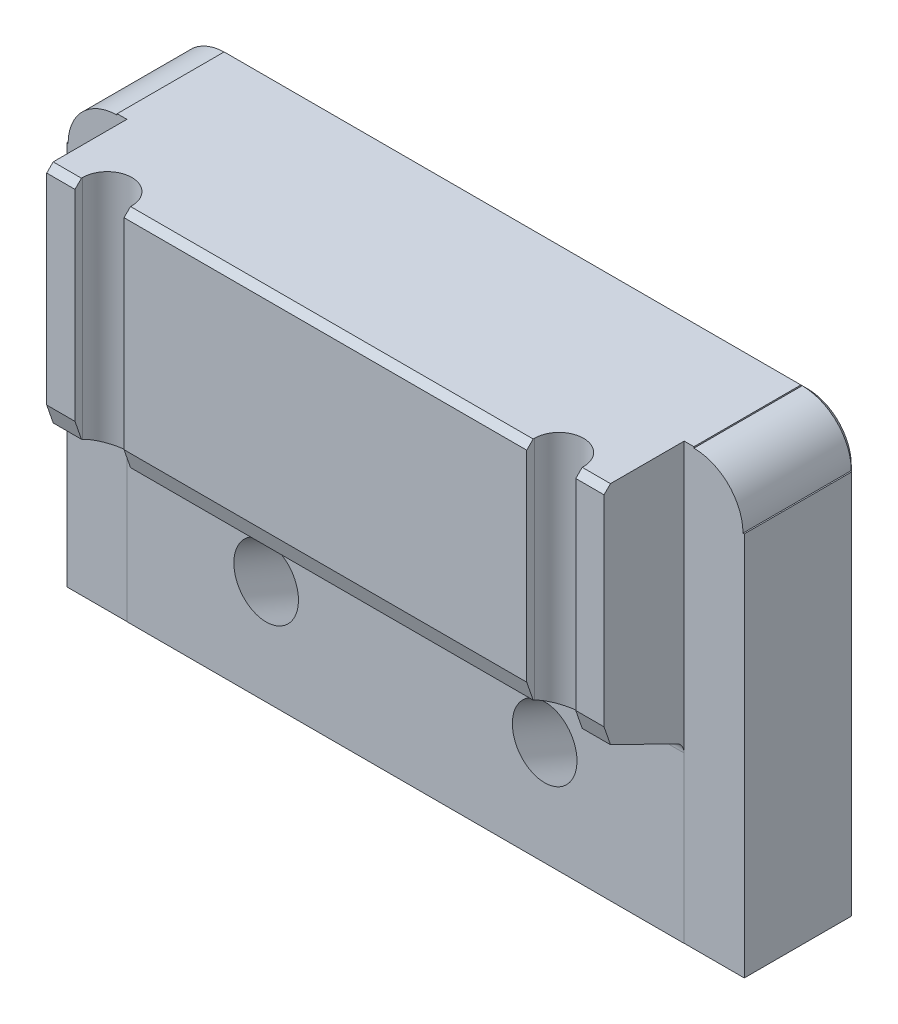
ISO-10303-21;
HEADER;
FILE_DESCRIPTION(('STEP AP214'),'2;1');
FILE_NAME('part.step','',(''),(''),'','','');
FILE_SCHEMA(('AUTOMOTIVE_DESIGN { 1 0 10303 214 1 1 1 1 }'));
ENDSEC;
DATA;
#1=APPLICATION_CONTEXT('core data for automotive mechanical design processes');
#2=APPLICATION_PROTOCOL_DEFINITION('international standard','automotive_design',2000,#1);
#3=PRODUCT_CONTEXT('',#1,'mechanical');
#4=PRODUCT('Part','Part','',(#3));
#5=PRODUCT_RELATED_PRODUCT_CATEGORY('part','',(#4));
#6=PRODUCT_DEFINITION_FORMATION('','',#4);
#7=PRODUCT_DEFINITION_CONTEXT('part definition',#1,'design');
#8=PRODUCT_DEFINITION('design','',#6,#7);
#9=PRODUCT_DEFINITION_SHAPE('','',#8);
#10=(LENGTH_UNIT() NAMED_UNIT(*) SI_UNIT(.MILLI.,.METRE.));
#11=(NAMED_UNIT(*) PLANE_ANGLE_UNIT() SI_UNIT($,.RADIAN.));
#12=(NAMED_UNIT(*) SI_UNIT($,.STERADIAN.) SOLID_ANGLE_UNIT());
#13=UNCERTAINTY_MEASURE_WITH_UNIT(LENGTH_MEASURE(1.E-05),#10,'distance_accuracy_value','');
#14=(GEOMETRIC_REPRESENTATION_CONTEXT(3) GLOBAL_UNCERTAINTY_ASSIGNED_CONTEXT((#13)) GLOBAL_UNIT_ASSIGNED_CONTEXT((#10,
#11,#12)) REPRESENTATION_CONTEXT('',''));
#15=CARTESIAN_POINT('',(0.,0.,0.));
#16=DIRECTION('',(0.,0.,1.));
#17=DIRECTION('',(1.,0.,0.));
#18=AXIS2_PLACEMENT_3D('',#15,#16,#17);
#19=CARTESIAN_POINT('',(-49.6316,0.,19.4691));
#20=DIRECTION('',(0.,0.,-1.));
#21=DIRECTION('',(-1.,0.,0.));
#22=AXIS2_PLACEMENT_3D('',#19,#20,#21);
#23=CONICAL_SURFACE('',#22,3.2639,1.02974425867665);
#24=CARTESIAN_POINT('',(-49.6316,0.,21.430248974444));
#25=VERTEX_POINT('',#24);
#26=VERTEX_LOOP('',#25);
#27=FACE_BOUND('',#26,.T.);
#28=CARTESIAN_POINT('',(-49.6316,0.,19.4691));
#29=DIRECTION('',(0.,0.,-1.));
#30=DIRECTION('',(-1.,0.,0.));
#31=AXIS2_PLACEMENT_3D('',#28,#29,#30);
#32=CIRCLE('',#31,3.2639);
#33=CARTESIAN_POINT('',(-52.8955,0.,19.4691));
#34=VERTEX_POINT('',#33);
#35=EDGE_CURVE('E12',#34,#34,#32,.T.);
#36=ORIENTED_EDGE('',*,*,#35,.T.);
#37=EDGE_LOOP('',(#36));
#38=FACE_BOUND('',#37,.T.);
#39=ADVANCED_FACE('F37',(#27,#38),#23,.F.);
#40=CARTESIAN_POINT('',(-49.6316,0.,0.));
#41=DIRECTION('',(0.,0.,-1.));
#42=DIRECTION('',(-1.,0.,0.));
#43=AXIS2_PLACEMENT_3D('',#40,#41,#42);
#44=CYLINDRICAL_SURFACE('',#43,3.2639);
#45=ORIENTED_EDGE('',*,*,#35,.F.);
#46=EDGE_LOOP('',(#45));
#47=FACE_BOUND('',#46,.T.);
#48=CARTESIAN_POINT('',(-49.6316,0.,15.24));
#49=DIRECTION('',(0.,0.,-1.));
#50=DIRECTION('',(-1.,0.,0.));
#51=AXIS2_PLACEMENT_3D('',#48,#49,#50);
#52=CIRCLE('',#51,3.2639);
#53=CARTESIAN_POINT('',(-52.8955,0.,15.24));
#54=VERTEX_POINT('',#53);
#55=EDGE_CURVE('E44',#54,#54,#52,.T.);
#56=ORIENTED_EDGE('',*,*,#55,.T.);
#57=EDGE_LOOP('',(#56));
#58=FACE_BOUND('',#57,.T.);
#59=ADVANCED_FACE('F668',(#47,#58),#44,.F.);
#60=CARTESIAN_POINT('',(-46.3677,0.,15.24));
#61=DIRECTION('',(0.,0.,1.));
#62=DIRECTION('',(1.,0.,0.));
#63=AXIS2_PLACEMENT_3D('',#60,#61,#62);
#64=PLANE('',#63);
#65=ORIENTED_EDGE('',*,*,#55,.F.);
#66=EDGE_LOOP('',(#65));
#67=FACE_BOUND('',#66,.T.);
#68=CARTESIAN_POINT('',(-49.6316,0.,15.24));
#69=DIRECTION('',(0.,0.,-1.));
#70=DIRECTION('',(-1.,0.,0.));
#71=AXIS2_PLACEMENT_3D('',#68,#69,#70);
#72=CIRCLE('',#71,3.96875);
#73=CARTESIAN_POINT('',(-53.60035,0.,15.24));
#74=VERTEX_POINT('',#73);
#75=EDGE_CURVE('E660',#74,#74,#72,.T.);
#76=ORIENTED_EDGE('',*,*,#75,.T.);
#77=EDGE_LOOP('',(#76));
#78=FACE_BOUND('',#77,.T.);
#79=ADVANCED_FACE('F670',(#67,#78),#64,.F.);
#80=CARTESIAN_POINT('',(-49.6316,0.,0.));
#81=DIRECTION('',(0.,0.,-1.));
#82=DIRECTION('',(-1.,0.,0.));
#83=AXIS2_PLACEMENT_3D('',#80,#81,#82);
#84=CYLINDRICAL_SURFACE('',#83,3.96875);
#85=ORIENTED_EDGE('',*,*,#75,.F.);
#86=EDGE_LOOP('',(#85));
#87=FACE_BOUND('',#86,.T.);
#88=CARTESIAN_POINT('',(-49.6316,0.,0.));
#89=DIRECTION('',(0.,0.,-1.));
#90=DIRECTION('',(-1.,0.,0.));
#91=AXIS2_PLACEMENT_3D('',#88,#89,#90);
#92=CIRCLE('',#91,3.96875);
#93=CARTESIAN_POINT('',(-53.60035,0.,0.));
#94=VERTEX_POINT('',#93);
#95=EDGE_CURVE('E663',#94,#94,#92,.T.);
#96=ORIENTED_EDGE('',*,*,#95,.T.);
#97=EDGE_LOOP('',(#96));
#98=FACE_BOUND('',#97,.T.);
#99=ADVANCED_FACE('F673',(#87,#98),#84,.F.);
#100=CARTESIAN_POINT('',(0.,0.,19.4691));
#101=DIRECTION('',(0.,0.,-1.));
#102=DIRECTION('',(-1.,0.,0.));
#103=AXIS2_PLACEMENT_3D('',#100,#101,#102);
#104=CONICAL_SURFACE('',#103,3.2639,1.02974425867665);
#105=CARTESIAN_POINT('',(0.,0.,21.430248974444));
#106=VERTEX_POINT('',#105);
#107=VERTEX_LOOP('',#106);
#108=FACE_BOUND('',#107,.T.);
#109=CARTESIAN_POINT('',(0.,0.,19.4691));
#110=DIRECTION('',(0.,0.,-1.));
#111=DIRECTION('',(-1.,0.,0.));
#112=AXIS2_PLACEMENT_3D('',#109,#110,#111);
#113=CIRCLE('',#112,3.2639);
#114=CARTESIAN_POINT('',(-3.2639,0.,19.4691));
#115=VERTEX_POINT('',#114);
#116=EDGE_CURVE('E657',#115,#115,#113,.T.);
#117=ORIENTED_EDGE('',*,*,#116,.T.);
#118=EDGE_LOOP('',(#117));
#119=FACE_BOUND('',#118,.T.);
#120=ADVANCED_FACE('F679',(#108,#119),#104,.F.);
#121=CARTESIAN_POINT('',(0.,0.,0.));
#122=DIRECTION('',(0.,0.,-1.));
#123=DIRECTION('',(-1.,0.,0.));
#124=AXIS2_PLACEMENT_3D('',#121,#122,#123);
#125=CYLINDRICAL_SURFACE('',#124,3.2639);
#126=ORIENTED_EDGE('',*,*,#116,.F.);
#127=EDGE_LOOP('',(#126));
#128=FACE_BOUND('',#127,.T.);
#129=CARTESIAN_POINT('',(0.,0.,15.24));
#130=DIRECTION('',(0.,0.,-1.));
#131=DIRECTION('',(-1.,0.,0.));
#132=AXIS2_PLACEMENT_3D('',#129,#130,#131);
#133=CIRCLE('',#132,3.2639);
#134=CARTESIAN_POINT('',(-3.2639,0.,15.24));
#135=VERTEX_POINT('',#134);
#136=EDGE_CURVE('E654',#135,#135,#133,.T.);
#137=ORIENTED_EDGE('',*,*,#136,.T.);
#138=EDGE_LOOP('',(#137));
#139=FACE_BOUND('',#138,.T.);
#140=ADVANCED_FACE('F847',(#128,#139),#125,.F.);
#141=CARTESIAN_POINT('',(3.2639,0.,15.24));
#142=DIRECTION('',(0.,0.,1.));
#143=DIRECTION('',(1.,0.,0.));
#144=AXIS2_PLACEMENT_3D('',#141,#142,#143);
#145=PLANE('',#144);
#146=ORIENTED_EDGE('',*,*,#136,.F.);
#147=EDGE_LOOP('',(#146));
#148=FACE_BOUND('',#147,.T.);
#149=CARTESIAN_POINT('',(0.,0.,15.24));
#150=DIRECTION('',(0.,0.,-1.));
#151=DIRECTION('',(-1.,0.,0.));
#152=AXIS2_PLACEMENT_3D('',#149,#150,#151);
#153=CIRCLE('',#152,3.96875);
#154=CARTESIAN_POINT('',(-3.96875,0.,15.24));
#155=VERTEX_POINT('',#154);
#156=EDGE_CURVE('E648',#155,#155,#153,.T.);
#157=ORIENTED_EDGE('',*,*,#156,.T.);
#158=EDGE_LOOP('',(#157));
#159=FACE_BOUND('',#158,.T.);
#160=ADVANCED_FACE('F850',(#148,#159),#145,.F.);
#161=CARTESIAN_POINT('',(0.,0.,0.));
#162=DIRECTION('',(0.,0.,-1.));
#163=DIRECTION('',(-1.,0.,0.));
#164=AXIS2_PLACEMENT_3D('',#161,#162,#163);
#165=CYLINDRICAL_SURFACE('',#164,3.96875);
#166=ORIENTED_EDGE('',*,*,#156,.F.);
#167=EDGE_LOOP('',(#166));
#168=FACE_BOUND('',#167,.T.);
#169=CARTESIAN_POINT('',(0.,0.,0.));
#170=DIRECTION('',(0.,0.,-1.));
#171=DIRECTION('',(-1.,0.,0.));
#172=AXIS2_PLACEMENT_3D('',#169,#170,#171);
#173=CIRCLE('',#172,3.96875);
#174=CARTESIAN_POINT('',(-3.96875,0.,0.));
#175=VERTEX_POINT('',#174);
#176=EDGE_CURVE('E651',#175,#175,#173,.T.);
#177=ORIENTED_EDGE('',*,*,#176,.T.);
#178=EDGE_LOOP('',(#177));
#179=FACE_BOUND('',#178,.T.);
#180=ADVANCED_FACE('F854',(#168,#179),#165,.F.);
#181=CARTESIAN_POINT('',(49.6316,0.,19.4691));
#182=DIRECTION('',(0.,0.,-1.));
#183=DIRECTION('',(-1.,0.,0.));
#184=AXIS2_PLACEMENT_3D('',#181,#182,#183);
#185=CONICAL_SURFACE('',#184,3.2639,1.02974425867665);
#186=CARTESIAN_POINT('',(49.6316,0.,21.430248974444));
#187=VERTEX_POINT('',#186);
#188=VERTEX_LOOP('',#187);
#189=FACE_BOUND('',#188,.T.);
#190=CARTESIAN_POINT('',(49.6316,0.,19.4691));
#191=DIRECTION('',(0.,0.,-1.));
#192=DIRECTION('',(-1.,0.,0.));
#193=AXIS2_PLACEMENT_3D('',#190,#191,#192);
#194=CIRCLE('',#193,3.2639);
#195=CARTESIAN_POINT('',(46.3677,0.,19.4691));
#196=VERTEX_POINT('',#195);
#197=EDGE_CURVE('E645',#196,#196,#194,.T.);
#198=ORIENTED_EDGE('',*,*,#197,.T.);
#199=EDGE_LOOP('',(#198));
#200=FACE_BOUND('',#199,.T.);
#201=ADVANCED_FACE('F858',(#189,#200),#185,.F.);
#202=CARTESIAN_POINT('',(49.6316,0.,0.));
#203=DIRECTION('',(0.,0.,-1.));
#204=DIRECTION('',(-1.,0.,0.));
#205=AXIS2_PLACEMENT_3D('',#202,#203,#204);
#206=CYLINDRICAL_SURFACE('',#205,3.2639);
#207=ORIENTED_EDGE('',*,*,#197,.F.);
#208=EDGE_LOOP('',(#207));
#209=FACE_BOUND('',#208,.T.);
#210=CARTESIAN_POINT('',(49.6316,0.,15.24));
#211=DIRECTION('',(0.,0.,-1.));
#212=DIRECTION('',(-1.,0.,0.));
#213=AXIS2_PLACEMENT_3D('',#210,#211,#212);
#214=CIRCLE('',#213,3.2639);
#215=CARTESIAN_POINT('',(46.3677,0.,15.24));
#216=VERTEX_POINT('',#215);
#217=EDGE_CURVE('E642',#216,#216,#214,.T.);
#218=ORIENTED_EDGE('',*,*,#217,.T.);
#219=EDGE_LOOP('',(#218));
#220=FACE_BOUND('',#219,.T.);
#221=ADVANCED_FACE('F862',(#209,#220),#206,.F.);
#222=CARTESIAN_POINT('',(52.8955,0.,15.24));
#223=DIRECTION('',(0.,0.,1.));
#224=DIRECTION('',(1.,0.,0.));
#225=AXIS2_PLACEMENT_3D('',#222,#223,#224);
#226=PLANE('',#225);
#227=ORIENTED_EDGE('',*,*,#217,.F.);
#228=EDGE_LOOP('',(#227));
#229=FACE_BOUND('',#228,.T.);
#230=CARTESIAN_POINT('',(49.6316,0.,15.24));
#231=DIRECTION('',(0.,0.,-1.));
#232=DIRECTION('',(-1.,0.,0.));
#233=AXIS2_PLACEMENT_3D('',#230,#231,#232);
#234=CIRCLE('',#233,3.96875);
#235=CARTESIAN_POINT('',(45.66285,0.,15.24));
#236=VERTEX_POINT('',#235);
#237=EDGE_CURVE('E636',#236,#236,#234,.T.);
#238=ORIENTED_EDGE('',*,*,#237,.T.);
#239=EDGE_LOOP('',(#238));
#240=FACE_BOUND('',#239,.T.);
#241=ADVANCED_FACE('F866',(#229,#240),#226,.F.);
#242=CARTESIAN_POINT('',(49.6316,0.,0.));
#243=DIRECTION('',(0.,0.,-1.));
#244=DIRECTION('',(-1.,0.,0.));
#245=AXIS2_PLACEMENT_3D('',#242,#243,#244);
#246=CYLINDRICAL_SURFACE('',#245,3.96875);
#247=ORIENTED_EDGE('',*,*,#237,.F.);
#248=EDGE_LOOP('',(#247));
#249=FACE_BOUND('',#248,.T.);
#250=CARTESIAN_POINT('',(49.6316,0.,0.));
#251=DIRECTION('',(0.,0.,-1.));
#252=DIRECTION('',(-1.,0.,0.));
#253=AXIS2_PLACEMENT_3D('',#250,#251,#252);
#254=CIRCLE('',#253,3.96875);
#255=CARTESIAN_POINT('',(45.66285,0.,0.));
#256=VERTEX_POINT('',#255);
#257=EDGE_CURVE('E639',#256,#256,#254,.T.);
#258=ORIENTED_EDGE('',*,*,#257,.T.);
#259=EDGE_LOOP('',(#258));
#260=FACE_BOUND('',#259,.T.);
#261=ADVANCED_FACE('F870',(#249,#260),#246,.F.);
#262=CARTESIAN_POINT('',(66.6623,1.98750960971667,38.1));
#263=DIRECTION('',(0.,0.,-1.));
#264=DIRECTION('',(-1.,0.,0.));
#265=AXIS2_PLACEMENT_3D('',#262,#263,#264);
#266=PLANE('',#265);
#267=DIRECTION('',(0.,-1.,0.));
#268=VECTOR('',#267,1.);
#269=CARTESIAN_POINT('',(-49.276,1.98750960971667,38.1));
#270=LINE('',#269,#268);
#271=CARTESIAN_POINT('',(-49.276,41.529,38.1));
#272=VERTEX_POINT('',#271);
#273=CARTESIAN_POINT('',(-49.276,1.98750960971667,38.1));
#274=VERTEX_POINT('',#273);
#275=EDGE_CURVE('E397',#272,#274,#270,.T.);
#276=ORIENTED_EDGE('',*,*,#275,.F.);
#277=DIRECTION('',(-1.,0.,0.));
#278=VECTOR('',#277,1.);
#279=CARTESIAN_POINT('',(66.6623,41.529,38.1));
#280=LINE('',#279,#278);
#281=CARTESIAN_POINT('',(-54.8386,41.529,38.1));
#282=VERTEX_POINT('',#281);
#283=EDGE_CURVE('E583',#272,#282,#280,.T.);
#284=ORIENTED_EDGE('',*,*,#283,.T.);
#285=DIRECTION('',(0.,-1.,0.));
#286=VECTOR('',#285,1.);
#287=CARTESIAN_POINT('',(-54.8386,64.3746517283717,38.1));
#288=LINE('',#287,#286);
#289=CARTESIAN_POINT('',(-54.8386,1.98750960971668,38.1));
#290=VERTEX_POINT('',#289);
#291=EDGE_CURVE('E442',#282,#290,#288,.T.);
#292=ORIENTED_EDGE('',*,*,#291,.T.);
#293=DIRECTION('',(-1.,0.,0.));
#294=VECTOR('',#293,1.);
#295=CARTESIAN_POINT('',(66.6623,1.98750960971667,38.1));
#296=LINE('',#295,#294);
#297=EDGE_CURVE('E496',#274,#290,#296,.T.);
#298=ORIENTED_EDGE('',*,*,#297,.F.);
#299=EDGE_LOOP('',(#276,#284,#292,#298));
#300=FACE_BOUND('',#299,.T.);
#301=ADVANCED_FACE('F874',(#300),#266,.F.);
#302=DIRECTION('',(0.,1.,0.));
#303=VECTOR('',#302,1.);
#304=CARTESIAN_POINT('',(39.624,1.98750960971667,38.1));
#305=LINE('',#304,#303);
#306=CARTESIAN_POINT('',(39.624,1.98750960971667,38.1));
#307=VERTEX_POINT('',#306);
#308=CARTESIAN_POINT('',(39.624,41.529,38.1));
#309=VERTEX_POINT('',#308);
#310=EDGE_CURVE('E420',#307,#309,#305,.T.);
#311=ORIENTED_EDGE('',*,*,#310,.T.);
#312=DIRECTION('',(-1.,0.,0.));
#313=VECTOR('',#312,1.);
#314=CARTESIAN_POINT('',(66.6623,41.529,38.1));
#315=LINE('',#314,#313);
#316=CARTESIAN_POINT('',(-39.624,41.529,38.1));
#317=VERTEX_POINT('',#316);
#318=EDGE_CURVE('E576',#309,#317,#315,.T.);
#319=ORIENTED_EDGE('',*,*,#318,.T.);
#320=DIRECTION('',(0.,1.,0.));
#321=VECTOR('',#320,1.);
#322=CARTESIAN_POINT('',(-39.624,1.98750960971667,38.1));
#323=LINE('',#322,#321);
#324=CARTESIAN_POINT('',(-39.624,1.98750960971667,38.1));
#325=VERTEX_POINT('',#324);
#326=EDGE_CURVE('E392',#325,#317,#323,.T.);
#327=ORIENTED_EDGE('',*,*,#326,.F.);
#328=EDGE_CURVE('E502',#307,#325,#296,.T.);
#329=ORIENTED_EDGE('',*,*,#328,.F.);
#330=EDGE_LOOP('',(#311,#319,#327,#329));
#331=FACE_BOUND('',#330,.T.);
#332=ADVANCED_FACE('F907',(#331),#266,.F.);
#333=CARTESIAN_POINT('',(66.6623,-1.70083820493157,36.83));
#334=DIRECTION('',(0.,0.325568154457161,-0.945518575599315));
#335=DIRECTION('',(0.,0.945518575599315,0.325568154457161));
#336=AXIS2_PLACEMENT_3D('',#333,#334,#335);
#337=PLANE('',#336);
#338=DIRECTION('',(0.,-0.945518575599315,-0.325568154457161));
#339=VECTOR('',#338,1.);
#340=CARTESIAN_POINT('',(-49.276,-1.70083820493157,36.83));
#341=LINE('',#340,#339);
#342=CARTESIAN_POINT('',(-49.276,-1.70083820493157,36.83));
#343=VERTEX_POINT('',#342);
#344=EDGE_CURVE('E395',#274,#343,#341,.T.);
#345=ORIENTED_EDGE('',*,*,#344,.F.);
#346=ORIENTED_EDGE('',*,*,#297,.T.);
#347=DIRECTION('',(0.,0.945518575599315,0.325568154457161));
#348=VECTOR('',#347,1.);
#349=CARTESIAN_POINT('',(-54.8386,-1.70083820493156,36.83));
#350=LINE('',#349,#348);
#351=CARTESIAN_POINT('',(-54.8386,-1.70083820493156,36.83));
#352=VERTEX_POINT('',#351);
#353=EDGE_CURVE('E478',#352,#290,#350,.T.);
#354=ORIENTED_EDGE('',*,*,#353,.F.);
#355=DIRECTION('',(-1.,0.,0.));
#356=VECTOR('',#355,1.);
#357=CARTESIAN_POINT('',(66.6623,-1.70083820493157,36.83));
#358=LINE('',#357,#356);
#359=EDGE_CURVE('E492',#343,#352,#358,.T.);
#360=ORIENTED_EDGE('',*,*,#359,.F.);
#361=EDGE_LOOP('',(#345,#346,#354,#360));
#362=FACE_BOUND('',#361,.T.);
#363=ADVANCED_FACE('F910',(#362),#337,.F.);
#364=DIRECTION('',(0.,0.945518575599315,0.325568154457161));
#365=VECTOR('',#364,1.);
#366=CARTESIAN_POINT('',(-39.624,-1.70083820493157,36.83));
#367=LINE('',#366,#365);
#368=CARTESIAN_POINT('',(-39.624,-1.70083820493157,36.83));
#369=VERTEX_POINT('',#368);
#370=EDGE_CURVE('E389',#369,#325,#367,.T.);
#371=ORIENTED_EDGE('',*,*,#370,.F.);
#372=CARTESIAN_POINT('',(39.624,-1.70083820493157,36.83));
#373=VERTEX_POINT('',#372);
#374=EDGE_CURVE('E497',#373,#369,#358,.T.);
#375=ORIENTED_EDGE('',*,*,#374,.F.);
#376=DIRECTION('',(0.,0.945518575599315,0.325568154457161));
#377=VECTOR('',#376,1.);
#378=CARTESIAN_POINT('',(39.624,-1.70083820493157,36.83));
#379=LINE('',#378,#377);
#380=EDGE_CURVE('E417',#373,#307,#379,.T.);
#381=ORIENTED_EDGE('',*,*,#380,.T.);
#382=ORIENTED_EDGE('',*,*,#328,.T.);
#383=EDGE_LOOP('',(#371,#375,#381,#382));
#384=FACE_BOUND('',#383,.T.);
#385=ADVANCED_FACE('F904',(#384),#337,.F.);
#386=CARTESIAN_POINT('',(66.6623,42.799,38.1));
#387=DIRECTION('',(0.,-1.,0.));
#388=DIRECTION('',(0.,0.,-1.));
#389=AXIS2_PLACEMENT_3D('',#386,#387,#388);
#390=PLANE('',#389);
#391=DIRECTION('',(0.,0.,-1.));
#392=VECTOR('',#391,1.);
#393=CARTESIAN_POINT('',(49.276,42.799,36.576));
#394=LINE('',#393,#392);
#395=CARTESIAN_POINT('',(49.276,42.799,36.83));
#396=VERTEX_POINT('',#395);
#397=CARTESIAN_POINT('',(49.276,42.799,36.576));
#398=VERTEX_POINT('',#397);
#399=EDGE_CURVE('E399',#396,#398,#394,.T.);
#400=ORIENTED_EDGE('',*,*,#399,.F.);
#401=DIRECTION('',(1.,0.,0.));
#402=VECTOR('',#401,1.);
#403=CARTESIAN_POINT('',(66.6623,42.799,36.83));
#404=LINE('',#403,#402);
#405=CARTESIAN_POINT('',(54.8386,42.799,36.83));
#406=VERTEX_POINT('',#405);
#407=EDGE_CURVE('E572',#396,#406,#404,.T.);
#408=ORIENTED_EDGE('',*,*,#407,.T.);
#409=DIRECTION('',(0.,0.,1.));
#410=VECTOR('',#409,1.);
#411=CARTESIAN_POINT('',(54.8386,42.799,38.1));
#412=LINE('',#411,#410);
#413=CARTESIAN_POINT('',(54.8386,42.799,22.3266));
#414=VERTEX_POINT('',#413);
#415=EDGE_CURVE('E470',#414,#406,#412,.T.);
#416=ORIENTED_EDGE('',*,*,#415,.F.);
#417=DIRECTION('',(-1.,0.,0.));
#418=VECTOR('',#417,1.);
#419=CARTESIAN_POINT('',(66.6623,42.799,22.3266));
#420=LINE('',#419,#418);
#421=CARTESIAN_POINT('',(56.7563,42.799,22.3266));
#422=VERTEX_POINT('',#421);
#423=EDGE_CURVE('E460',#422,#414,#420,.T.);
#424=ORIENTED_EDGE('',*,*,#423,.F.);
#425=DIRECTION('',(0.,0.,-1.));
#426=VECTOR('',#425,1.);
#427=CARTESIAN_POINT('',(56.7563,42.799,38.1));
#428=LINE('',#427,#426);
#429=CARTESIAN_POINT('',(56.7563,42.799,1.27000000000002));
#430=VERTEX_POINT('',#429);
#431=EDGE_CURVE('E436',#422,#430,#428,.T.);
#432=ORIENTED_EDGE('',*,*,#431,.T.);
#433=DIRECTION('',(-1.,0.,0.));
#434=VECTOR('',#433,1.);
#435=CARTESIAN_POINT('',(66.6623,42.799,1.27000000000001));
#436=LINE('',#435,#434);
#437=CARTESIAN_POINT('',(-56.7563,42.799,1.27000000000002));
#438=VERTEX_POINT('',#437);
#439=EDGE_CURVE('E565',#430,#438,#436,.T.);
#440=ORIENTED_EDGE('',*,*,#439,.T.);
#441=DIRECTION('',(0.,0.,-1.));
#442=VECTOR('',#441,1.);
#443=CARTESIAN_POINT('',(-56.7563,42.799,38.1));
#444=LINE('',#443,#442);
#445=CARTESIAN_POINT('',(-56.7563,42.799,22.3266));
#446=VERTEX_POINT('',#445);
#447=EDGE_CURVE('E430',#446,#438,#444,.T.);
#448=ORIENTED_EDGE('',*,*,#447,.F.);
#449=CARTESIAN_POINT('',(-54.8386,42.799,22.3266));
#450=VERTEX_POINT('',#449);
#451=EDGE_CURVE('E455',#450,#446,#420,.T.);
#452=ORIENTED_EDGE('',*,*,#451,.F.);
#453=DIRECTION('',(0.,0.,-1.));
#454=VECTOR('',#453,1.);
#455=CARTESIAN_POINT('',(-54.8386,42.799,38.1));
#456=LINE('',#455,#454);
#457=CARTESIAN_POINT('',(-54.8386,42.799,36.83));
#458=VERTEX_POINT('',#457);
#459=EDGE_CURVE('E481',#458,#450,#456,.T.);
#460=ORIENTED_EDGE('',*,*,#459,.F.);
#461=DIRECTION('',(1.,0.,0.));
#462=VECTOR('',#461,1.);
#463=CARTESIAN_POINT('',(66.6623,42.799,36.83));
#464=LINE('',#463,#462);
#465=CARTESIAN_POINT('',(-49.276,42.799,36.83));
#466=VERTEX_POINT('',#465);
#467=EDGE_CURVE('E568',#458,#466,#464,.T.);
#468=ORIENTED_EDGE('',*,*,#467,.T.);
#469=DIRECTION('',(0.,0.,-1.));
#470=VECTOR('',#469,1.);
#471=CARTESIAN_POINT('',(-49.276,42.799,36.576));
#472=LINE('',#471,#470);
#473=CARTESIAN_POINT('',(-49.276,42.799,36.576));
#474=VERTEX_POINT('',#473);
#475=EDGE_CURVE('E383',#466,#474,#472,.T.);
#476=ORIENTED_EDGE('',*,*,#475,.T.);
#477=CARTESIAN_POINT('',(-44.45,42.799,36.576));
#478=DIRECTION('',(0.,-1.,0.));
#479=DIRECTION('',(0.,0.,-1.));
#480=AXIS2_PLACEMENT_3D('',#477,#478,#479);
#481=CIRCLE('',#480,4.826);
#482=CARTESIAN_POINT('',(-39.624,42.799,36.576));
#483=VERTEX_POINT('',#482);
#484=EDGE_CURVE('E379',#474,#483,#481,.T.);
#485=ORIENTED_EDGE('',*,*,#484,.T.);
#486=DIRECTION('',(0.,0.,1.));
#487=VECTOR('',#486,1.);
#488=CARTESIAN_POINT('',(-39.624,42.799,56.3881036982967));
#489=LINE('',#488,#487);
#490=CARTESIAN_POINT('',(-39.624,42.799,36.83));
#491=VERTEX_POINT('',#490);
#492=EDGE_CURVE('E376',#483,#491,#489,.T.);
#493=ORIENTED_EDGE('',*,*,#492,.T.);
#494=DIRECTION('',(1.,0.,0.));
#495=VECTOR('',#494,1.);
#496=CARTESIAN_POINT('',(66.6623,42.799,36.83));
#497=LINE('',#496,#495);
#498=CARTESIAN_POINT('',(39.624,42.799,36.83));
#499=VERTEX_POINT('',#498);
#500=EDGE_CURVE('E570',#491,#499,#497,.T.);
#501=ORIENTED_EDGE('',*,*,#500,.T.);
#502=DIRECTION('',(0.,0.,1.));
#503=VECTOR('',#502,1.);
#504=CARTESIAN_POINT('',(39.624,42.799,56.3881036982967));
#505=LINE('',#504,#503);
#506=CARTESIAN_POINT('',(39.624,42.799,36.576));
#507=VERTEX_POINT('',#506);
#508=EDGE_CURVE('E404',#507,#499,#505,.T.);
#509=ORIENTED_EDGE('',*,*,#508,.F.);
#510=CARTESIAN_POINT('',(44.45,42.799,36.576));
#511=DIRECTION('',(0.,1.,0.));
#512=DIRECTION('',(0.,0.,-1.));
#513=AXIS2_PLACEMENT_3D('',#510,#511,#512);
#514=CIRCLE('',#513,4.826);
#515=EDGE_CURVE('E401',#398,#507,#514,.T.);
#516=ORIENTED_EDGE('',*,*,#515,.F.);
#517=EDGE_LOOP('',(#400,#408,#416,#424,#432,#440,#448,#452,#460,#468,#476,#485,#493,#501,#509,#516));
#518=FACE_BOUND('',#517,.T.);
#519=ADVANCED_FACE('F777',(#518),#390,.F.);
#520=CARTESIAN_POINT('',(66.6623,-8.762230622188,22.352));
#521=DIRECTION('',(0.,0.89879404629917,-0.438371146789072));
#522=DIRECTION('',(0.,0.438371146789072,0.89879404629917));
#523=AXIS2_PLACEMENT_3D('',#520,#521,#522);
#524=PLANE('',#523);
#525=DIRECTION('',(0.,0.438371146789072,0.89879404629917));
#526=VECTOR('',#525,1.);
#527=CARTESIAN_POINT('',(-54.8386,-8.762230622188,22.352));
#528=LINE('',#527,#526);
#529=CARTESIAN_POINT('',(-54.8386,-8.06646189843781,23.7785372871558));
#530=VERTEX_POINT('',#529);
#531=EDGE_CURVE('E476',#530,#352,#528,.T.);
#532=ORIENTED_EDGE('',*,*,#531,.F.);
#533=DIRECTION('',(-1.,0.,0.));
#534=VECTOR('',#533,1.);
#535=CARTESIAN_POINT('',(54.8386,-8.06646189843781,23.7785372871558));
#536=LINE('',#535,#534);
#537=CARTESIAN_POINT('',(54.8386,-8.06646189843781,23.7785372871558));
#538=VERTEX_POINT('',#537);
#539=EDGE_CURVE('E546',#530,#538,#536,.F.);
#540=ORIENTED_EDGE('',*,*,#539,.T.);
#541=DIRECTION('',(0.,-0.438371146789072,-0.89879404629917));
#542=VECTOR('',#541,1.);
#543=CARTESIAN_POINT('',(54.8386,-8.762230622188,22.352));
#544=LINE('',#543,#542);
#545=CARTESIAN_POINT('',(54.8386,-1.70083820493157,36.83));
#546=VERTEX_POINT('',#545);
#547=EDGE_CURVE('E465',#546,#538,#544,.T.);
#548=ORIENTED_EDGE('',*,*,#547,.F.);
#549=CARTESIAN_POINT('',(49.276,-1.70083820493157,36.83));
#550=VERTEX_POINT('',#549);
#551=EDGE_CURVE('E493',#546,#550,#358,.T.);
#552=ORIENTED_EDGE('',*,*,#551,.T.);
#553=DIRECTION('',(0.,-0.438371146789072,-0.89879404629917));
#554=VECTOR('',#553,1.);
#555=CARTESIAN_POINT('',(49.276,-8.762230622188,22.352));
#556=LINE('',#555,#554);
#557=CARTESIAN_POINT('',(49.276,-1.82472228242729,36.576));
#558=VERTEX_POINT('',#557);
#559=EDGE_CURVE('E527',#550,#558,#556,.T.);
#560=ORIENTED_EDGE('',*,*,#559,.T.);
#561=CARTESIAN_POINT('',(44.45,-1.8247222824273,36.576));
#562=DIRECTION('',(0.,0.89879404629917,-0.438371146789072));
#563=DIRECTION('',(0.,0.438371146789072,0.89879404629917));
#564=AXIS2_PLACEMENT_3D('',#561,#562,#563);
#565=ELLIPSE('',#564,5.36941696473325,4.826);
#566=CARTESIAN_POINT('',(39.624,-1.8247222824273,36.576));
#567=VERTEX_POINT('',#566);
#568=EDGE_CURVE('E530',#558,#567,#565,.T.);
#569=ORIENTED_EDGE('',*,*,#568,.T.);
#570=DIRECTION('',(0.,0.438371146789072,0.89879404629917));
#571=VECTOR('',#570,1.);
#572=CARTESIAN_POINT('',(39.624,-8.762230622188,22.352));
#573=LINE('',#572,#571);
#574=EDGE_CURVE('E533',#567,#373,#573,.T.);
#575=ORIENTED_EDGE('',*,*,#574,.T.);
#576=ORIENTED_EDGE('',*,*,#374,.T.);
#577=DIRECTION('',(0.,0.438371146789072,0.89879404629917));
#578=VECTOR('',#577,1.);
#579=CARTESIAN_POINT('',(-39.624,-8.762230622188,22.352));
#580=LINE('',#579,#578);
#581=CARTESIAN_POINT('',(-39.624,-1.8247222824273,36.576));
#582=VERTEX_POINT('',#581);
#583=EDGE_CURVE('E536',#582,#369,#580,.T.);
#584=ORIENTED_EDGE('',*,*,#583,.F.);
#585=CARTESIAN_POINT('',(-44.45,-1.8247222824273,36.576));
#586=DIRECTION('',(0.,0.89879404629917,-0.438371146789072));
#587=DIRECTION('',(0.,0.438371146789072,0.89879404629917));
#588=AXIS2_PLACEMENT_3D('',#585,#586,#587);
#589=ELLIPSE('',#588,5.36941696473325,4.826);
#590=CARTESIAN_POINT('',(-49.276,-1.8247222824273,36.576));
#591=VERTEX_POINT('',#590);
#592=EDGE_CURVE('E538',#591,#582,#589,.F.);
#593=ORIENTED_EDGE('',*,*,#592,.F.);
#594=DIRECTION('',(0.,-0.438371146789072,-0.89879404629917));
#595=VECTOR('',#594,1.);
#596=CARTESIAN_POINT('',(-49.276,-8.762230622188,22.352));
#597=LINE('',#596,#595);
#598=EDGE_CURVE('E541',#343,#591,#597,.T.);
#599=ORIENTED_EDGE('',*,*,#598,.F.);
#600=ORIENTED_EDGE('',*,*,#359,.T.);
#601=EDGE_LOOP('',(#532,#540,#548,#552,#560,#569,#575,#576,#584,#593,#599,#600));
#602=FACE_BOUND('',#601,.T.);
#603=ADVANCED_FACE('F804',(#602),#524,.F.);
#604=CARTESIAN_POINT('',(-66.6623,42.799,0.));
#605=DIRECTION('',(-1.,0.,0.));
#606=DIRECTION('',(0.,0.,1.));
#607=AXIS2_PLACEMENT_3D('',#604,#605,#606);
#608=PLANE('',#607);
#609=DIRECTION('',(0.,0.,-1.));
#610=VECTOR('',#609,1.);
#611=CARTESIAN_POINT('',(-66.6623,32.893,0.));
#612=LINE('',#611,#610);
#613=CARTESIAN_POINT('',(-66.6623,32.893,22.3266));
#614=VERTEX_POINT('',#613);
#615=CARTESIAN_POINT('',(-66.6623,32.893,1.27));
#616=VERTEX_POINT('',#615);
#617=EDGE_CURVE('E426',#614,#616,#612,.T.);
#618=ORIENTED_EDGE('',*,*,#617,.T.);
#619=DIRECTION('',(0.,-1.,0.));
#620=VECTOR('',#619,1.);
#621=CARTESIAN_POINT('',(-66.6623,-42.799,1.27));
#622=LINE('',#621,#620);
#623=CARTESIAN_POINT('',(-66.6623,-42.799,1.27));
#624=VERTEX_POINT('',#623);
#625=EDGE_CURVE('E607',#616,#624,#622,.T.);
#626=ORIENTED_EDGE('',*,*,#625,.T.);
#627=DIRECTION('',(0.,0.,-1.));
#628=VECTOR('',#627,1.);
#629=CARTESIAN_POINT('',(-66.6623,-42.799,0.));
#630=LINE('',#629,#628);
#631=CARTESIAN_POINT('',(-66.6623,-42.799,22.3266));
#632=VERTEX_POINT('',#631);
#633=EDGE_CURVE('E483',#632,#624,#630,.T.);
#634=ORIENTED_EDGE('',*,*,#633,.F.);
#635=DIRECTION('',(0.,1.,0.));
#636=VECTOR('',#635,1.);
#637=CARTESIAN_POINT('',(-66.6623,42.799,22.3266));
#638=LINE('',#637,#636);
#639=EDGE_CURVE('E501',#632,#614,#638,.T.);
#640=ORIENTED_EDGE('',*,*,#639,.T.);
#641=EDGE_LOOP('',(#618,#626,#634,#640));
#642=FACE_BOUND('',#641,.T.);
#643=ADVANCED_FACE('F687',(#642),#608,.T.);
#644=CARTESIAN_POINT('',(66.6623,42.799,0.));
#645=DIRECTION('',(0.,0.,1.));
#646=DIRECTION('',(1.,0.,0.));
#647=AXIS2_PLACEMENT_3D('',#644,#645,#646);
#648=PLANE('',#647);
#649=ORIENTED_EDGE('',*,*,#95,.F.);
#650=EDGE_LOOP('',(#649));
#651=FACE_BOUND('',#650,.T.);
#652=ORIENTED_EDGE('',*,*,#176,.F.);
#653=EDGE_LOOP('',(#652));
#654=FACE_BOUND('',#653,.T.);
#655=ORIENTED_EDGE('',*,*,#257,.F.);
#656=EDGE_LOOP('',(#655));
#657=FACE_BOUND('',#656,.T.);
#658=CARTESIAN_POINT('',(49.6316,-32.512,0.));
#659=DIRECTION('',(0.,0.,-1.));
#660=DIRECTION('',(-1.,0.,0.));
#661=AXIS2_PLACEMENT_3D('',#658,#659,#660);
#662=CIRCLE('',#661,3.96875);
#663=CARTESIAN_POINT('',(45.66285,-32.512,0.));
#664=VERTEX_POINT('',#663);
#665=EDGE_CURVE('E298',#664,#664,#662,.T.);
#666=ORIENTED_EDGE('',*,*,#665,.F.);
#667=EDGE_LOOP('',(#666));
#668=FACE_BOUND('',#667,.T.);
#669=CARTESIAN_POINT('',(49.6316,32.512,0.));
#670=DIRECTION('',(0.,0.,-1.));
#671=DIRECTION('',(-1.,0.,0.));
#672=AXIS2_PLACEMENT_3D('',#669,#670,#671);
#673=CIRCLE('',#672,3.96875);
#674=CARTESIAN_POINT('',(45.66285,32.512,0.));
#675=VERTEX_POINT('',#674);
#676=EDGE_CURVE('E310',#675,#675,#673,.T.);
#677=ORIENTED_EDGE('',*,*,#676,.F.);
#678=EDGE_LOOP('',(#677));
#679=FACE_BOUND('',#678,.T.);
#680=CARTESIAN_POINT('',(0.,32.512,0.));
#681=DIRECTION('',(0.,0.,-1.));
#682=DIRECTION('',(-1.,0.,0.));
#683=AXIS2_PLACEMENT_3D('',#680,#681,#682);
#684=CIRCLE('',#683,3.96875);
#685=CARTESIAN_POINT('',(-3.96875,32.512,0.));
#686=VERTEX_POINT('',#685);
#687=EDGE_CURVE('E322',#686,#686,#684,.T.);
#688=ORIENTED_EDGE('',*,*,#687,.F.);
#689=EDGE_LOOP('',(#688));
#690=FACE_BOUND('',#689,.T.);
#691=CARTESIAN_POINT('',(0.,-32.512,0.));
#692=DIRECTION('',(0.,0.,-1.));
#693=DIRECTION('',(-1.,0.,0.));
#694=AXIS2_PLACEMENT_3D('',#691,#692,#693);
#695=CIRCLE('',#694,3.96875);
#696=CARTESIAN_POINT('',(-3.96875,-32.512,0.));
#697=VERTEX_POINT('',#696);
#698=EDGE_CURVE('E334',#697,#697,#695,.T.);
#699=ORIENTED_EDGE('',*,*,#698,.F.);
#700=EDGE_LOOP('',(#699));
#701=FACE_BOUND('',#700,.T.);
#702=CARTESIAN_POINT('',(-49.6316,-32.512,0.));
#703=DIRECTION('',(0.,0.,-1.));
#704=DIRECTION('',(-1.,0.,0.));
#705=AXIS2_PLACEMENT_3D('',#702,#703,#704);
#706=CIRCLE('',#705,3.96875);
#707=CARTESIAN_POINT('',(-53.60035,-32.512,0.));
#708=VERTEX_POINT('',#707);
#709=EDGE_CURVE('E346',#708,#708,#706,.T.);
#710=ORIENTED_EDGE('',*,*,#709,.F.);
#711=EDGE_LOOP('',(#710));
#712=FACE_BOUND('',#711,.T.);
#713=CARTESIAN_POINT('',(-49.6316,32.512,0.));
#714=DIRECTION('',(0.,0.,-1.));
#715=DIRECTION('',(-1.,0.,0.));
#716=AXIS2_PLACEMENT_3D('',#713,#714,#715);
#717=CIRCLE('',#716,3.96875);
#718=CARTESIAN_POINT('',(-53.60035,32.512,0.));
#719=VERTEX_POINT('',#718);
#720=EDGE_CURVE('E358',#719,#719,#717,.T.);
#721=ORIENTED_EDGE('',*,*,#720,.F.);
#722=EDGE_LOOP('',(#721));
#723=FACE_BOUND('',#722,.T.);
#724=CARTESIAN_POINT('',(-27.4066,-31.7246,0.));
#725=DIRECTION('',(0.,0.,1.));
#726=DIRECTION('',(0.,-1.,0.));
#727=AXIS2_PLACEMENT_3D('',#724,#725,#726);
#728=ELLIPSE('',#727,9.51977598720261,8.763);
#729=CARTESIAN_POINT('',(-27.4066,-41.2443759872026,0.));
#730=VERTEX_POINT('',#729);
#731=EDGE_CURVE('E372',#730,#730,#728,.T.);
#732=ORIENTED_EDGE('',*,*,#731,.T.);
#733=EDGE_LOOP('',(#732));
#734=FACE_BOUND('',#733,.T.);
#735=CARTESIAN_POINT('',(27.4066,-31.7246,0.));
#736=DIRECTION('',(0.,0.,1.));
#737=DIRECTION('',(0.,-1.,0.));
#738=AXIS2_PLACEMENT_3D('',#735,#736,#737);
#739=ELLIPSE('',#738,9.51977598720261,8.763);
#740=CARTESIAN_POINT('',(27.4066,-41.2443759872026,0.));
#741=VERTEX_POINT('',#740);
#742=EDGE_CURVE('E380',#741,#741,#739,.T.);
#743=ORIENTED_EDGE('',*,*,#742,.T.);
#744=EDGE_LOOP('',(#743));
#745=FACE_BOUND('',#744,.T.);
#746=DIRECTION('',(1.,0.,0.));
#747=VECTOR('',#746,1.);
#748=CARTESIAN_POINT('',(66.6623,41.529,0.));
#749=LINE('',#748,#747);
#750=CARTESIAN_POINT('',(-56.7563,41.529,0.));
#751=VERTEX_POINT('',#750);
#752=CARTESIAN_POINT('',(56.7563,41.529,0.));
#753=VERTEX_POINT('',#752);
#754=EDGE_CURVE('E600',#751,#753,#749,.T.);
#755=ORIENTED_EDGE('',*,*,#754,.T.);
#756=CARTESIAN_POINT('',(56.7563,32.893,0.));
#757=DIRECTION('',(0.,0.,1.));
#758=DIRECTION('',(1.,0.,0.));
#759=AXIS2_PLACEMENT_3D('',#756,#757,#758);
#760=CIRCLE('',#759,8.636);
#761=CARTESIAN_POINT('',(65.3923,32.893,0.));
#762=VERTEX_POINT('',#761);
#763=EDGE_CURVE('E620',#753,#762,#760,.F.);
#764=ORIENTED_EDGE('',*,*,#763,.T.);
#765=DIRECTION('',(0.,-1.,0.));
#766=VECTOR('',#765,1.);
#767=CARTESIAN_POINT('',(65.3923,42.799,0.));
#768=LINE('',#767,#766);
#769=CARTESIAN_POINT('',(65.3923,-41.529,0.));
#770=VERTEX_POINT('',#769);
#771=EDGE_CURVE('E593',#762,#770,#768,.T.);
#772=ORIENTED_EDGE('',*,*,#771,.T.);
#773=DIRECTION('',(-1.,0.,0.));
#774=VECTOR('',#773,1.);
#775=CARTESIAN_POINT('',(66.6623,-41.529,0.));
#776=LINE('',#775,#774);
#777=CARTESIAN_POINT('',(-65.3923,-41.529,0.));
#778=VERTEX_POINT('',#777);
#779=EDGE_CURVE('E595',#770,#778,#776,.T.);
#780=ORIENTED_EDGE('',*,*,#779,.T.);
#781=DIRECTION('',(0.,1.,0.));
#782=VECTOR('',#781,1.);
#783=CARTESIAN_POINT('',(-65.3923,32.893,0.));
#784=LINE('',#783,#782);
#785=CARTESIAN_POINT('',(-65.3923,32.893,0.));
#786=VERTEX_POINT('',#785);
#787=EDGE_CURVE('E597',#778,#786,#784,.T.);
#788=ORIENTED_EDGE('',*,*,#787,.T.);
#789=CARTESIAN_POINT('',(-56.7563,32.893,0.));
#790=DIRECTION('',(0.,0.,1.));
#791=DIRECTION('',(1.,0.,0.));
#792=AXIS2_PLACEMENT_3D('',#789,#790,#791);
#793=CIRCLE('',#792,8.636);
#794=EDGE_CURVE('E616',#786,#751,#793,.F.);
#795=ORIENTED_EDGE('',*,*,#794,.T.);
#796=EDGE_LOOP('',(#755,#764,#772,#780,#788,#795));
#797=FACE_BOUND('',#796,.T.);
#798=ADVANCED_FACE('F683',(#651,#654,#657,#668,#679,#690,#701,#712,#723,#734,#745,#797),#648,.F.);
#799=CARTESIAN_POINT('',(0.,3.16521253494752,22.3266));
#800=DIRECTION('',(0.,0.,1.));
#801=DIRECTION('',(1.,0.,0.));
#802=AXIS2_PLACEMENT_3D('',#799,#800,#801);
#803=PLANE('',#802);
#804=ORIENTED_EDGE('',*,*,#451,.T.);
#805=DIRECTION('',(0.,-1.,0.));
#806=VECTOR('',#805,1.);
#807=CARTESIAN_POINT('',(-56.7563,3.16521253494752,22.3266));
#808=LINE('',#807,#806);
#809=CARTESIAN_POINT('',(-56.7563,42.545,22.3266));
#810=VERTEX_POINT('',#809);
#811=EDGE_CURVE('E524',#446,#810,#808,.T.);
#812=ORIENTED_EDGE('',*,*,#811,.T.);
#813=CARTESIAN_POINT('',(-56.7563,32.893,22.3266));
#814=DIRECTION('',(0.,0.,1.));
#815=DIRECTION('',(1.,0.,0.));
#816=AXIS2_PLACEMENT_3D('',#813,#814,#815);
#817=CIRCLE('',#816,9.652);
#818=CARTESIAN_POINT('',(-66.4083,32.893,22.3266));
#819=VERTEX_POINT('',#818);
#820=EDGE_CURVE('E521',#810,#819,#817,.T.);
#821=ORIENTED_EDGE('',*,*,#820,.T.);
#822=DIRECTION('',(-1.,0.,0.));
#823=VECTOR('',#822,1.);
#824=CARTESIAN_POINT('',(0.,32.893,22.3266));
#825=LINE('',#824,#823);
#826=EDGE_CURVE('E518',#819,#614,#825,.T.);
#827=ORIENTED_EDGE('',*,*,#826,.T.);
#828=ORIENTED_EDGE('',*,*,#639,.F.);
#829=DIRECTION('',(1.,0.,0.));
#830=VECTOR('',#829,1.);
#831=CARTESIAN_POINT('',(66.6623,-42.799,22.3266));
#832=LINE('',#831,#830);
#833=CARTESIAN_POINT('',(-54.8386,-42.799,22.3266));
#834=VERTEX_POINT('',#833);
#835=EDGE_CURVE('E453',#632,#834,#832,.T.);
#836=ORIENTED_EDGE('',*,*,#835,.T.);
#837=DIRECTION('',(0.,-1.,0.));
#838=VECTOR('',#837,1.);
#839=CARTESIAN_POINT('',(-54.8386,64.3746517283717,22.3266));
#840=LINE('',#839,#838);
#841=EDGE_CURVE('E447',#450,#834,#840,.T.);
#842=ORIENTED_EDGE('',*,*,#841,.F.);
#843=EDGE_LOOP('',(#804,#812,#821,#827,#828,#836,#842));
#844=FACE_BOUND('',#843,.T.);
#845=ADVANCED_FACE('F686',(#844),#803,.T.);
#846=DIRECTION('',(0.,1.,0.));
#847=VECTOR('',#846,1.);
#848=CARTESIAN_POINT('',(54.8386,64.3746517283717,38.1));
#849=LINE('',#848,#847);
#850=CARTESIAN_POINT('',(54.8386,1.98750960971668,38.1));
#851=VERTEX_POINT('',#850);
#852=CARTESIAN_POINT('',(54.8386,41.529,38.1));
#853=VERTEX_POINT('',#852);
#854=EDGE_CURVE('E444',#851,#853,#849,.T.);
#855=ORIENTED_EDGE('',*,*,#854,.T.);
#856=DIRECTION('',(-1.,0.,0.));
#857=VECTOR('',#856,1.);
#858=CARTESIAN_POINT('',(66.6623,41.529,38.1));
#859=LINE('',#858,#857);
#860=CARTESIAN_POINT('',(49.276,41.529,38.1));
#861=VERTEX_POINT('',#860);
#862=EDGE_CURVE('E552',#853,#861,#859,.T.);
#863=ORIENTED_EDGE('',*,*,#862,.T.);
#864=DIRECTION('',(0.,-1.,0.));
#865=VECTOR('',#864,1.);
#866=CARTESIAN_POINT('',(49.276,1.98750960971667,38.1));
#867=LINE('',#866,#865);
#868=CARTESIAN_POINT('',(49.276,1.98750960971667,38.1));
#869=VERTEX_POINT('',#868);
#870=EDGE_CURVE('E415',#861,#869,#867,.T.);
#871=ORIENTED_EDGE('',*,*,#870,.T.);
#872=EDGE_CURVE('E498',#851,#869,#296,.T.);
#873=ORIENTED_EDGE('',*,*,#872,.F.);
#874=EDGE_LOOP('',(#855,#863,#871,#873));
#875=FACE_BOUND('',#874,.T.);
#876=ADVANCED_FACE('F791',(#875),#266,.F.);
#877=ORIENTED_EDGE('',*,*,#872,.T.);
#878=DIRECTION('',(0.,-0.945518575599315,-0.325568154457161));
#879=VECTOR('',#878,1.);
#880=CARTESIAN_POINT('',(49.276,-1.70083820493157,36.83));
#881=LINE('',#880,#879);
#882=EDGE_CURVE('E410',#869,#550,#881,.T.);
#883=ORIENTED_EDGE('',*,*,#882,.T.);
#884=ORIENTED_EDGE('',*,*,#551,.F.);
#885=DIRECTION('',(0.,-0.945518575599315,-0.325568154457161));
#886=VECTOR('',#885,1.);
#887=CARTESIAN_POINT('',(54.8386,-1.70083820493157,36.83));
#888=LINE('',#887,#886);
#889=EDGE_CURVE('E468',#851,#546,#888,.T.);
#890=ORIENTED_EDGE('',*,*,#889,.F.);
#891=EDGE_LOOP('',(#877,#883,#884,#890));
#892=FACE_BOUND('',#891,.T.);
#893=ADVANCED_FACE('F799',(#892),#337,.F.);
#894=CARTESIAN_POINT('',(66.6623,-42.799,22.352));
#895=DIRECTION('',(0.,0.,-1.));
#896=DIRECTION('',(-1.,0.,0.));
#897=AXIS2_PLACEMENT_3D('',#894,#895,#896);
#898=PLANE('',#897);
#899=CARTESIAN_POINT('',(-27.4066,-22.2367389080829,22.352));
#900=DIRECTION('',(0.,0.,-1.));
#901=DIRECTION('',(0.,-1.,0.));
#902=AXIS2_PLACEMENT_3D('',#899,#900,#901);
#903=ELLIPSE('',#902,6.90528678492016,6.35635);
#904=CARTESIAN_POINT('',(-27.4066,-29.1420256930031,22.352));
#905=VERTEX_POINT('',#904);
#906=EDGE_CURVE('E367',#905,#905,#903,.T.);
#907=ORIENTED_EDGE('',*,*,#906,.T.);
#908=EDGE_LOOP('',(#907));
#909=FACE_BOUND('',#908,.T.);
#910=CARTESIAN_POINT('',(27.4066,-22.2367389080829,22.352));
#911=DIRECTION('',(0.,0.,-1.));
#912=DIRECTION('',(0.,-1.,0.));
#913=AXIS2_PLACEMENT_3D('',#910,#911,#912);
#914=ELLIPSE('',#913,6.90528678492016,6.35635);
#915=CARTESIAN_POINT('',(27.4066,-29.1420256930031,22.352));
#916=VERTEX_POINT('',#915);
#917=EDGE_CURVE('E375',#916,#916,#914,.T.);
#918=ORIENTED_EDGE('',*,*,#917,.T.);
#919=EDGE_LOOP('',(#918));
#920=FACE_BOUND('',#919,.T.);
#921=DIRECTION('',(0.,-1.,0.));
#922=VECTOR('',#921,1.);
#923=CARTESIAN_POINT('',(54.8386,-42.799,22.352));
#924=LINE('',#923,#922);
#925=CARTESIAN_POINT('',(54.8386,-10.3493987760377,22.352));
#926=VERTEX_POINT('',#925);
#927=CARTESIAN_POINT('',(54.8386,-42.799,22.352));
#928=VERTEX_POINT('',#927);
#929=EDGE_CURVE('E463',#926,#928,#924,.T.);
#930=ORIENTED_EDGE('',*,*,#929,.F.);
#931=DIRECTION('',(-1.,0.,0.));
#932=VECTOR('',#931,1.);
#933=CARTESIAN_POINT('',(-54.8386,-10.3493987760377,22.352));
#934=LINE('',#933,#932);
#935=CARTESIAN_POINT('',(-54.8386,-10.3493987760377,22.352));
#936=VERTEX_POINT('',#935);
#937=EDGE_CURVE('E543',#926,#936,#934,.T.);
#938=ORIENTED_EDGE('',*,*,#937,.T.);
#939=DIRECTION('',(0.,1.,0.));
#940=VECTOR('',#939,1.);
#941=CARTESIAN_POINT('',(-54.8386,-42.799,22.352));
#942=LINE('',#941,#940);
#943=CARTESIAN_POINT('',(-54.8386,-42.799,22.352));
#944=VERTEX_POINT('',#943);
#945=EDGE_CURVE('E473',#944,#936,#942,.T.);
#946=ORIENTED_EDGE('',*,*,#945,.F.);
#947=DIRECTION('',(-1.,0.,0.));
#948=VECTOR('',#947,1.);
#949=CARTESIAN_POINT('',(66.6623,-42.799,22.352));
#950=LINE('',#949,#948);
#951=EDGE_CURVE('E487',#928,#944,#950,.T.);
#952=ORIENTED_EDGE('',*,*,#951,.F.);
#953=EDGE_LOOP('',(#930,#938,#946,#952));
#954=FACE_BOUND('',#953,.T.);
#955=ADVANCED_FACE('F813',(#909,#920,#954),#898,.F.);
#956=CARTESIAN_POINT('',(66.6623,-42.799,0.));
#957=DIRECTION('',(0.,1.,0.));
#958=DIRECTION('',(0.,0.,1.));
#959=AXIS2_PLACEMENT_3D('',#956,#957,#958);
#960=PLANE('',#959);
#961=ORIENTED_EDGE('',*,*,#633,.T.);
#962=DIRECTION('',(1.,0.,0.));
#963=VECTOR('',#962,1.);
#964=CARTESIAN_POINT('',(66.6623,-42.799,1.27));
#965=LINE('',#964,#963);
#966=CARTESIAN_POINT('',(66.6623,-42.799,1.27));
#967=VERTEX_POINT('',#966);
#968=EDGE_CURVE('E609',#624,#967,#965,.T.);
#969=ORIENTED_EDGE('',*,*,#968,.T.);
#970=DIRECTION('',(0.,0.,-1.));
#971=VECTOR('',#970,1.);
#972=CARTESIAN_POINT('',(66.6623,-42.799,0.));
#973=LINE('',#972,#971);
#974=CARTESIAN_POINT('',(66.6623,-42.799,22.3266));
#975=VERTEX_POINT('',#974);
#976=EDGE_CURVE('E484',#975,#967,#973,.T.);
#977=ORIENTED_EDGE('',*,*,#976,.F.);
#978=CARTESIAN_POINT('',(54.8386,-42.799,22.3266));
#979=VERTEX_POINT('',#978);
#980=EDGE_CURVE('E456',#979,#975,#832,.T.);
#981=ORIENTED_EDGE('',*,*,#980,.F.);
#982=DIRECTION('',(0.,0.,-1.));
#983=VECTOR('',#982,1.);
#984=CARTESIAN_POINT('',(54.8386,-42.799,0.));
#985=LINE('',#984,#983);
#986=EDGE_CURVE('E505',#928,#979,#985,.T.);
#987=ORIENTED_EDGE('',*,*,#986,.F.);
#988=ORIENTED_EDGE('',*,*,#951,.T.);
#989=DIRECTION('',(0.,0.,1.));
#990=VECTOR('',#989,1.);
#991=CARTESIAN_POINT('',(-54.8386,-42.799,0.));
#992=LINE('',#991,#990);
#993=EDGE_CURVE('E507',#834,#944,#992,.T.);
#994=ORIENTED_EDGE('',*,*,#993,.F.);
#995=ORIENTED_EDGE('',*,*,#835,.F.);
#996=EDGE_LOOP('',(#961,#969,#977,#981,#987,#988,#994,#995));
#997=FACE_BOUND('',#996,.T.);
#998=ADVANCED_FACE('F743',(#997),#960,.F.);
#999=CARTESIAN_POINT('',(66.6623,42.799,0.));
#1000=DIRECTION('',(-1.,0.,0.));
#1001=DIRECTION('',(0.,0.,1.));
#1002=AXIS2_PLACEMENT_3D('',#999,#1000,#1001);
#1003=PLANE('',#1002);
#1004=ORIENTED_EDGE('',*,*,#976,.T.);
#1005=DIRECTION('',(0.,1.,0.));
#1006=VECTOR('',#1005,1.);
#1007=CARTESIAN_POINT('',(66.6623,42.799,1.27));
#1008=LINE('',#1007,#1006);
#1009=CARTESIAN_POINT('',(66.6623,32.893,1.27));
#1010=VERTEX_POINT('',#1009);
#1011=EDGE_CURVE('E611',#967,#1010,#1008,.T.);
#1012=ORIENTED_EDGE('',*,*,#1011,.T.);
#1013=DIRECTION('',(0.,0.,1.));
#1014=VECTOR('',#1013,1.);
#1015=CARTESIAN_POINT('',(66.6623,32.893,0.));
#1016=LINE('',#1015,#1014);
#1017=CARTESIAN_POINT('',(66.6623,32.893,22.3266));
#1018=VERTEX_POINT('',#1017);
#1019=EDGE_CURVE('E440',#1010,#1018,#1016,.T.);
#1020=ORIENTED_EDGE('',*,*,#1019,.T.);
#1021=DIRECTION('',(0.,1.,0.));
#1022=VECTOR('',#1021,1.);
#1023=CARTESIAN_POINT('',(66.6623,42.799,22.3266));
#1024=LINE('',#1023,#1022);
#1025=EDGE_CURVE('E459',#975,#1018,#1024,.T.);
#1026=ORIENTED_EDGE('',*,*,#1025,.F.);
#1027=EDGE_LOOP('',(#1004,#1012,#1020,#1026));
#1028=FACE_BOUND('',#1027,.T.);
#1029=ADVANCED_FACE('F741',(#1028),#1003,.F.);
#1030=CARTESIAN_POINT('',(-54.8386,64.3746517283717,22.3266));
#1031=DIRECTION('',(-1.,0.,0.));
#1032=DIRECTION('',(0.,-1.,0.));
#1033=AXIS2_PLACEMENT_3D('',#1030,#1031,#1032);
#1034=PLANE('',#1033);
#1035=ORIENTED_EDGE('',*,*,#291,.F.);
#1036=DIRECTION('',(0.,-0.707106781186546,0.70710678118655));
#1037=VECTOR('',#1036,1.);
#1038=CARTESIAN_POINT('',(-54.8386,60.8385258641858,18.7904741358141));
#1039=LINE('',#1038,#1037);
#1040=EDGE_CURVE('E586',#282,#458,#1039,.F.);
#1041=ORIENTED_EDGE('',*,*,#1040,.T.);
#1042=ORIENTED_EDGE('',*,*,#459,.T.);
#1043=ORIENTED_EDGE('',*,*,#841,.T.);
#1044=ORIENTED_EDGE('',*,*,#993,.T.);
#1045=ORIENTED_EDGE('',*,*,#945,.T.);
#1046=CARTESIAN_POINT('',(-54.8386,-10.3493987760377,24.892));
#1047=DIRECTION('',(-1.,0.,0.));
#1048=DIRECTION('',(0.,-1.,0.));
#1049=AXIS2_PLACEMENT_3D('',#1046,#1047,#1048);
#1050=CIRCLE('',#1049,2.54);
#1051=EDGE_CURVE('E548',#936,#530,#1050,.F.);
#1052=ORIENTED_EDGE('',*,*,#1051,.T.);
#1053=ORIENTED_EDGE('',*,*,#531,.T.);
#1054=ORIENTED_EDGE('',*,*,#353,.T.);
#1055=EDGE_LOOP('',(#1035,#1041,#1042,#1043,#1044,#1045,#1052,#1053,#1054));
#1056=FACE_BOUND('',#1055,.T.);
#1057=ADVANCED_FACE('F818',(#1056),#1034,.T.);
#1058=CARTESIAN_POINT('',(54.8386,64.3746517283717,22.3266));
#1059=DIRECTION('',(1.,0.,0.));
#1060=DIRECTION('',(0.,1.,0.));
#1061=AXIS2_PLACEMENT_3D('',#1058,#1059,#1060);
#1062=PLANE('',#1061);
#1063=ORIENTED_EDGE('',*,*,#415,.T.);
#1064=DIRECTION('',(0.,0.707106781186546,-0.70710678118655));
#1065=VECTOR('',#1064,1.);
#1066=CARTESIAN_POINT('',(54.8386,60.8385258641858,18.7904741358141));
#1067=LINE('',#1066,#1065);
#1068=EDGE_CURVE('E574',#406,#853,#1067,.F.);
#1069=ORIENTED_EDGE('',*,*,#1068,.T.);
#1070=ORIENTED_EDGE('',*,*,#854,.F.);
#1071=ORIENTED_EDGE('',*,*,#889,.T.);
#1072=ORIENTED_EDGE('',*,*,#547,.T.);
#1073=CARTESIAN_POINT('',(54.8386,-10.3493987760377,24.892));
#1074=DIRECTION('',(1.,0.,0.));
#1075=DIRECTION('',(0.,1.,0.));
#1076=AXIS2_PLACEMENT_3D('',#1073,#1074,#1075);
#1077=CIRCLE('',#1076,2.54);
#1078=EDGE_CURVE('E550',#538,#926,#1077,.F.);
#1079=ORIENTED_EDGE('',*,*,#1078,.T.);
#1080=ORIENTED_EDGE('',*,*,#929,.T.);
#1081=ORIENTED_EDGE('',*,*,#986,.T.);
#1082=DIRECTION('',(0.,1.,0.));
#1083=VECTOR('',#1082,1.);
#1084=CARTESIAN_POINT('',(54.8386,64.3746517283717,22.3266));
#1085=LINE('',#1084,#1083);
#1086=EDGE_CURVE('E450',#979,#414,#1085,.T.);
#1087=ORIENTED_EDGE('',*,*,#1086,.T.);
#1088=EDGE_LOOP('',(#1063,#1069,#1070,#1071,#1072,#1079,#1080,#1081,#1087));
#1089=FACE_BOUND('',#1088,.T.);
#1090=ADVANCED_FACE('F786',(#1089),#1062,.T.);
#1091=DIRECTION('',(1.,0.,0.));
#1092=VECTOR('',#1091,1.);
#1093=CARTESIAN_POINT('',(0.,32.893,22.3266));
#1094=LINE('',#1093,#1092);
#1095=CARTESIAN_POINT('',(66.4083,32.893,22.3266));
#1096=VERTEX_POINT('',#1095);
#1097=EDGE_CURVE('E515',#1096,#1018,#1094,.T.);
#1098=ORIENTED_EDGE('',*,*,#1097,.F.);
#1099=CARTESIAN_POINT('',(56.7563,32.893,22.3266));
#1100=DIRECTION('',(0.,0.,1.));
#1101=DIRECTION('',(1.,0.,0.));
#1102=AXIS2_PLACEMENT_3D('',#1099,#1100,#1101);
#1103=CIRCLE('',#1102,9.652);
#1104=CARTESIAN_POINT('',(56.7563,42.545,22.3266));
#1105=VERTEX_POINT('',#1104);
#1106=EDGE_CURVE('E512',#1105,#1096,#1103,.F.);
#1107=ORIENTED_EDGE('',*,*,#1106,.F.);
#1108=DIRECTION('',(0.,-1.,0.));
#1109=VECTOR('',#1108,1.);
#1110=CARTESIAN_POINT('',(56.7563,3.16521253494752,22.3266));
#1111=LINE('',#1110,#1109);
#1112=EDGE_CURVE('E509',#422,#1105,#1111,.T.);
#1113=ORIENTED_EDGE('',*,*,#1112,.F.);
#1114=ORIENTED_EDGE('',*,*,#423,.T.);
#1115=ORIENTED_EDGE('',*,*,#1086,.F.);
#1116=ORIENTED_EDGE('',*,*,#980,.T.);
#1117=ORIENTED_EDGE('',*,*,#1025,.T.);
#1118=EDGE_LOOP('',(#1098,#1107,#1113,#1114,#1115,#1116,#1117));
#1119=FACE_BOUND('',#1118,.T.);
#1120=ADVANCED_FACE('F735',(#1119),#803,.T.);
#1121=CARTESIAN_POINT('',(66.4083,32.893,0.));
#1122=DIRECTION('',(0.,-1.,0.));
#1123=DIRECTION('',(0.,0.,-1.));
#1124=AXIS2_PLACEMENT_3D('',#1121,#1122,#1123);
#1125=PLANE('',#1124);
#1126=ORIENTED_EDGE('',*,*,#1019,.F.);
#1127=DIRECTION('',(0.707106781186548,0.,0.707106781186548));
#1128=VECTOR('',#1127,1.);
#1129=CARTESIAN_POINT('',(66.6623,32.893,1.27));
#1130=LINE('',#1129,#1128);
#1131=CARTESIAN_POINT('',(66.4083,32.893,1.016));
#1132=VERTEX_POINT('',#1131);
#1133=EDGE_CURVE('E613',#1010,#1132,#1130,.F.);
#1134=ORIENTED_EDGE('',*,*,#1133,.T.);
#1135=DIRECTION('',(0.,0.,1.));
#1136=VECTOR('',#1135,1.);
#1137=CARTESIAN_POINT('',(66.4083,32.893,0.));
#1138=LINE('',#1137,#1136);
#1139=EDGE_CURVE('E434',#1132,#1096,#1138,.T.);
#1140=ORIENTED_EDGE('',*,*,#1139,.T.);
#1141=ORIENTED_EDGE('',*,*,#1097,.T.);
#1142=EDGE_LOOP('',(#1126,#1134,#1140,#1141));
#1143=FACE_BOUND('',#1142,.T.);
#1144=ADVANCED_FACE('F727',(#1143),#1125,.F.);
#1145=CARTESIAN_POINT('',(56.7563,50.165,0.));
#1146=DIRECTION('',(-1.,0.,0.));
#1147=DIRECTION('',(0.,0.,1.));
#1148=AXIS2_PLACEMENT_3D('',#1145,#1146,#1147);
#1149=PLANE('',#1148);
#1150=DIRECTION('',(0.,0.,1.));
#1151=VECTOR('',#1150,1.);
#1152=CARTESIAN_POINT('',(56.7563,42.545,0.));
#1153=LINE('',#1152,#1151);
#1154=CARTESIAN_POINT('',(56.7563,42.545,1.01600000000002));
#1155=VERTEX_POINT('',#1154);
#1156=EDGE_CURVE('E433',#1155,#1105,#1153,.T.);
#1157=ORIENTED_EDGE('',*,*,#1156,.F.);
#1158=DIRECTION('',(0.,-0.707106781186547,-0.707106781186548));
#1159=VECTOR('',#1158,1.);
#1160=CARTESIAN_POINT('',(56.7563,42.799,1.27000000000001));
#1161=LINE('',#1160,#1159);
#1162=EDGE_CURVE('E603',#1155,#430,#1161,.F.);
#1163=ORIENTED_EDGE('',*,*,#1162,.T.);
#1164=ORIENTED_EDGE('',*,*,#431,.F.);
#1165=ORIENTED_EDGE('',*,*,#1112,.T.);
#1166=EDGE_LOOP('',(#1157,#1163,#1164,#1165));
#1167=FACE_BOUND('',#1166,.T.);
#1168=ADVANCED_FACE('F781',(#1167),#1149,.F.);
#1169=CARTESIAN_POINT('',(56.7563,32.893,0.));
#1170=DIRECTION('',(0.,0.,1.));
#1171=DIRECTION('',(1.,0.,0.));
#1172=AXIS2_PLACEMENT_3D('',#1169,#1170,#1171);
#1173=CYLINDRICAL_SURFACE('',#1172,9.652);
#1174=ORIENTED_EDGE('',*,*,#1139,.F.);
#1175=CARTESIAN_POINT('',(56.7563,32.893,1.01599999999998));
#1176=DIRECTION('',(0.,0.,1.));
#1177=DIRECTION('',(1.,0.,0.));
#1178=AXIS2_PLACEMENT_3D('',#1175,#1176,#1177);
#1179=CIRCLE('',#1178,9.652);
#1180=EDGE_CURVE('E625',#1132,#1155,#1179,.T.);
#1181=ORIENTED_EDGE('',*,*,#1180,.T.);
#1182=ORIENTED_EDGE('',*,*,#1156,.T.);
#1183=ORIENTED_EDGE('',*,*,#1106,.T.);
#1184=EDGE_LOOP('',(#1174,#1181,#1182,#1183));
#1185=FACE_BOUND('',#1184,.T.);
#1186=ADVANCED_FACE('F729',(#1185),#1173,.T.);
#1187=CARTESIAN_POINT('',(-56.7563,50.165,0.));
#1188=DIRECTION('',(-1.,0.,0.));
#1189=DIRECTION('',(0.,0.,1.));
#1190=AXIS2_PLACEMENT_3D('',#1187,#1188,#1189);
#1191=PLANE('',#1190);
#1192=ORIENTED_EDGE('',*,*,#447,.T.);
#1193=DIRECTION('',(0.,0.707106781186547,0.707106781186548));
#1194=VECTOR('',#1193,1.);
#1195=CARTESIAN_POINT('',(-56.7563,45.847,4.318));
#1196=LINE('',#1195,#1194);
#1197=CARTESIAN_POINT('',(-56.7563,42.545,1.01600000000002));
#1198=VERTEX_POINT('',#1197);
#1199=EDGE_CURVE('E590',#438,#1198,#1196,.F.);
#1200=ORIENTED_EDGE('',*,*,#1199,.T.);
#1201=DIRECTION('',(0.,0.,1.));
#1202=VECTOR('',#1201,1.);
#1203=CARTESIAN_POINT('',(-56.7563,42.545,0.));
#1204=LINE('',#1203,#1202);
#1205=EDGE_CURVE('E424',#1198,#810,#1204,.T.);
#1206=ORIENTED_EDGE('',*,*,#1205,.T.);
#1207=ORIENTED_EDGE('',*,*,#811,.F.);
#1208=EDGE_LOOP('',(#1192,#1200,#1206,#1207));
#1209=FACE_BOUND('',#1208,.T.);
#1210=ADVANCED_FACE('F765',(#1209),#1191,.T.);
#1211=CARTESIAN_POINT('',(-56.7563,32.893,0.));
#1212=DIRECTION('',(0.,0.,1.));
#1213=DIRECTION('',(1.,0.,0.));
#1214=AXIS2_PLACEMENT_3D('',#1211,#1212,#1213);
#1215=CYLINDRICAL_SURFACE('',#1214,9.652);
#1216=ORIENTED_EDGE('',*,*,#1205,.F.);
#1217=CARTESIAN_POINT('',(-56.7563,32.893,1.01600000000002));
#1218=DIRECTION('',(0.,0.,1.));
#1219=DIRECTION('',(1.,0.,0.));
#1220=AXIS2_PLACEMENT_3D('',#1217,#1218,#1219);
#1221=CIRCLE('',#1220,9.652);
#1222=CARTESIAN_POINT('',(-66.4083,32.893,1.016));
#1223=VERTEX_POINT('',#1222);
#1224=EDGE_CURVE('E631',#1198,#1223,#1221,.T.);
#1225=ORIENTED_EDGE('',*,*,#1224,.T.);
#1226=DIRECTION('',(0.,0.,1.));
#1227=VECTOR('',#1226,1.);
#1228=CARTESIAN_POINT('',(-66.4083,32.893,0.));
#1229=LINE('',#1228,#1227);
#1230=EDGE_CURVE('E423',#1223,#819,#1229,.T.);
#1231=ORIENTED_EDGE('',*,*,#1230,.T.);
#1232=ORIENTED_EDGE('',*,*,#820,.F.);
#1233=EDGE_LOOP('',(#1216,#1225,#1231,#1232));
#1234=FACE_BOUND('',#1233,.T.);
#1235=ADVANCED_FACE('F769',(#1234),#1215,.T.);
#1236=CARTESIAN_POINT('',(-66.4083,32.893,0.));
#1237=DIRECTION('',(0.,1.,0.));
#1238=DIRECTION('',(0.,0.,1.));
#1239=AXIS2_PLACEMENT_3D('',#1236,#1237,#1238);
#1240=PLANE('',#1239);
#1241=ORIENTED_EDGE('',*,*,#1230,.F.);
#1242=DIRECTION('',(-0.707106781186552,0.,0.707106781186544));
#1243=VECTOR('',#1242,1.);
#1244=CARTESIAN_POINT('',(-65.9003,32.893,0.508));
#1245=LINE('',#1244,#1243);
#1246=EDGE_CURVE('E605',#1223,#616,#1245,.T.);
#1247=ORIENTED_EDGE('',*,*,#1246,.T.);
#1248=ORIENTED_EDGE('',*,*,#617,.F.);
#1249=ORIENTED_EDGE('',*,*,#826,.F.);
#1250=EDGE_LOOP('',(#1241,#1247,#1248,#1249));
#1251=FACE_BOUND('',#1250,.T.);
#1252=ADVANCED_FACE('F821',(#1251),#1240,.T.);
#1253=CARTESIAN_POINT('',(39.624,-42.799,56.3881036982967));
#1254=DIRECTION('',(-1.,0.,0.));
#1255=DIRECTION('',(0.,0.,1.));
#1256=AXIS2_PLACEMENT_3D('',#1253,#1254,#1255);
#1257=PLANE('',#1256);
#1258=ORIENTED_EDGE('',*,*,#508,.T.);
#1259=DIRECTION('',(0.,0.707106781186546,-0.70710678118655));
#1260=VECTOR('',#1259,1.);
#1261=CARTESIAN_POINT('',(39.624,41.529,38.1));
#1262=LINE('',#1261,#1260);
#1263=EDGE_CURVE('E581',#499,#309,#1262,.F.);
#1264=ORIENTED_EDGE('',*,*,#1263,.T.);
#1265=ORIENTED_EDGE('',*,*,#310,.F.);
#1266=ORIENTED_EDGE('',*,*,#380,.F.);
#1267=ORIENTED_EDGE('',*,*,#574,.F.);
#1268=DIRECTION('',(0.,1.,0.));
#1269=VECTOR('',#1268,1.);
#1270=CARTESIAN_POINT('',(39.624,-42.799,36.576));
#1271=LINE('',#1270,#1269);
#1272=EDGE_CURVE('E408',#567,#507,#1271,.T.);
#1273=ORIENTED_EDGE('',*,*,#1272,.T.);
#1274=EDGE_LOOP('',(#1258,#1264,#1265,#1266,#1267,#1273));
#1275=FACE_BOUND('',#1274,.T.);
#1276=ADVANCED_FACE('F823',(#1275),#1257,.F.);
#1277=CARTESIAN_POINT('',(44.45,-42.799,36.576));
#1278=DIRECTION('',(0.,1.,0.));
#1279=DIRECTION('',(0.,0.,1.));
#1280=AXIS2_PLACEMENT_3D('',#1277,#1278,#1279);
#1281=CYLINDRICAL_SURFACE('',#1280,4.826);
#1282=DIRECTION('',(0.,1.,0.));
#1283=VECTOR('',#1282,1.);
#1284=CARTESIAN_POINT('',(49.276,-42.799,36.576));
#1285=LINE('',#1284,#1283);
#1286=EDGE_CURVE('E407',#558,#398,#1285,.T.);
#1287=ORIENTED_EDGE('',*,*,#1286,.T.);
#1288=ORIENTED_EDGE('',*,*,#515,.T.);
#1289=ORIENTED_EDGE('',*,*,#1272,.F.);
#1290=ORIENTED_EDGE('',*,*,#568,.F.);
#1291=EDGE_LOOP('',(#1287,#1288,#1289,#1290));
#1292=FACE_BOUND('',#1291,.T.);
#1293=ADVANCED_FACE('F829',(#1292),#1281,.F.);
#1294=CARTESIAN_POINT('',(49.276,-42.799,36.576));
#1295=DIRECTION('',(1.,0.,0.));
#1296=DIRECTION('',(0.,0.,-1.));
#1297=AXIS2_PLACEMENT_3D('',#1294,#1295,#1296);
#1298=PLANE('',#1297);
#1299=ORIENTED_EDGE('',*,*,#870,.F.);
#1300=DIRECTION('',(0.,-0.707106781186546,0.70710678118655));
#1301=VECTOR('',#1300,1.);
#1302=CARTESIAN_POINT('',(49.276,41.529,38.1));
#1303=LINE('',#1302,#1301);
#1304=EDGE_CURVE('E563',#861,#396,#1303,.F.);
#1305=ORIENTED_EDGE('',*,*,#1304,.T.);
#1306=ORIENTED_EDGE('',*,*,#399,.T.);
#1307=ORIENTED_EDGE('',*,*,#1286,.F.);
#1308=ORIENTED_EDGE('',*,*,#559,.F.);
#1309=ORIENTED_EDGE('',*,*,#882,.F.);
#1310=EDGE_LOOP('',(#1299,#1305,#1306,#1307,#1308,#1309));
#1311=FACE_BOUND('',#1310,.T.);
#1312=ADVANCED_FACE('F795',(#1311),#1298,.F.);
#1313=CARTESIAN_POINT('',(-49.276,-42.799,36.576));
#1314=DIRECTION('',(1.,0.,0.));
#1315=DIRECTION('',(0.,0.,-1.));
#1316=AXIS2_PLACEMENT_3D('',#1313,#1314,#1315);
#1317=PLANE('',#1316);
#1318=ORIENTED_EDGE('',*,*,#475,.F.);
#1319=DIRECTION('',(0.,0.707106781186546,-0.70710678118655));
#1320=VECTOR('',#1319,1.);
#1321=CARTESIAN_POINT('',(-49.276,0.127000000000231,79.502));
#1322=LINE('',#1321,#1320);
#1323=EDGE_CURVE('E588',#466,#272,#1322,.F.);
#1324=ORIENTED_EDGE('',*,*,#1323,.T.);
#1325=ORIENTED_EDGE('',*,*,#275,.T.);
#1326=ORIENTED_EDGE('',*,*,#344,.T.);
#1327=ORIENTED_EDGE('',*,*,#598,.T.);
#1328=DIRECTION('',(0.,1.,0.));
#1329=VECTOR('',#1328,1.);
#1330=CARTESIAN_POINT('',(-49.276,-42.799,36.576));
#1331=LINE('',#1330,#1329);
#1332=EDGE_CURVE('E386',#591,#474,#1331,.T.);
#1333=ORIENTED_EDGE('',*,*,#1332,.T.);
#1334=EDGE_LOOP('',(#1318,#1324,#1325,#1326,#1327,#1333));
#1335=FACE_BOUND('',#1334,.T.);
#1336=ADVANCED_FACE('F1308',(#1335),#1317,.T.);
#1337=CARTESIAN_POINT('',(-44.45,-42.799,36.576));
#1338=DIRECTION('',(0.,1.,0.));
#1339=DIRECTION('',(0.,0.,1.));
#1340=AXIS2_PLACEMENT_3D('',#1337,#1338,#1339);
#1341=CYLINDRICAL_SURFACE('',#1340,4.826);
#1342=ORIENTED_EDGE('',*,*,#592,.T.);
#1343=DIRECTION('',(0.,1.,0.));
#1344=VECTOR('',#1343,1.);
#1345=CARTESIAN_POINT('',(-39.624,-42.799,36.576));
#1346=LINE('',#1345,#1344);
#1347=EDGE_CURVE('E385',#582,#483,#1346,.T.);
#1348=ORIENTED_EDGE('',*,*,#1347,.T.);
#1349=ORIENTED_EDGE('',*,*,#484,.F.);
#1350=ORIENTED_EDGE('',*,*,#1332,.F.);
#1351=EDGE_LOOP('',(#1342,#1348,#1349,#1350));
#1352=FACE_BOUND('',#1351,.T.);
#1353=ADVANCED_FACE('F1299',(#1352),#1341,.F.);
#1354=CARTESIAN_POINT('',(-39.624,-42.799,56.3881036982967));
#1355=DIRECTION('',(-1.,0.,0.));
#1356=DIRECTION('',(0.,0.,1.));
#1357=AXIS2_PLACEMENT_3D('',#1354,#1355,#1356);
#1358=PLANE('',#1357);
#1359=ORIENTED_EDGE('',*,*,#326,.T.);
#1360=DIRECTION('',(0.,-0.707106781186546,0.70710678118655));
#1361=VECTOR('',#1360,1.);
#1362=CARTESIAN_POINT('',(-39.624,-9.77905184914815,89.4080518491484));
#1363=LINE('',#1362,#1361);
#1364=EDGE_CURVE('E579',#317,#491,#1363,.F.);
#1365=ORIENTED_EDGE('',*,*,#1364,.T.);
#1366=ORIENTED_EDGE('',*,*,#492,.F.);
#1367=ORIENTED_EDGE('',*,*,#1347,.F.);
#1368=ORIENTED_EDGE('',*,*,#583,.T.);
#1369=ORIENTED_EDGE('',*,*,#370,.T.);
#1370=EDGE_LOOP('',(#1359,#1365,#1366,#1367,#1368,#1369));
#1371=FACE_BOUND('',#1370,.T.);
#1372=ADVANCED_FACE('F901',(#1371),#1358,.T.);
#1373=CARTESIAN_POINT('',(66.6623,-10.3493987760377,24.892));
#1374=DIRECTION('',(1.,0.,0.));
#1375=DIRECTION('',(0.,0.,-1.));
#1376=AXIS2_PLACEMENT_3D('',#1373,#1374,#1375);
#1377=CYLINDRICAL_SURFACE('',#1376,2.54);
#1378=ORIENTED_EDGE('',*,*,#1078,.F.);
#1379=ORIENTED_EDGE('',*,*,#539,.F.);
#1380=ORIENTED_EDGE('',*,*,#1051,.F.);
#1381=ORIENTED_EDGE('',*,*,#937,.F.);
#1382=EDGE_LOOP('',(#1378,#1379,#1380,#1381));
#1383=FACE_BOUND('',#1382,.T.);
#1384=ADVANCED_FACE('F808',(#1383),#1377,.F.);
#1385=CARTESIAN_POINT('',(27.4066,-46.3739575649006,-34.511723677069));
#1386=DIRECTION('',(0.,-0.390731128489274,-0.92050485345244));
#1387=DIRECTION('',(0.,0.92050485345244,-0.390731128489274));
#1388=AXIS2_PLACEMENT_3D('',#1385,#1386,#1387);
#1389=CYLINDRICAL_SURFACE('',#1388,8.763);
#1390=CARTESIAN_POINT('',(27.4066,-29.8900573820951,4.32191156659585));
#1391=DIRECTION('',(0.,-0.390731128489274,-0.92050485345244));
#1392=DIRECTION('',(0.,0.92050485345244,-0.390731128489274));
#1393=AXIS2_PLACEMENT_3D('',#1390,#1391,#1392);
#1394=CIRCLE('',#1393,8.763);
#1395=CARTESIAN_POINT('',(27.4066,-21.8236733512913,0.897934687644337));
#1396=VERTEX_POINT('',#1395);
#1397=EDGE_CURVE('E371',#1396,#1396,#1394,.T.);
#1398=ORIENTED_EDGE('',*,*,#1397,.F.);
#1399=EDGE_LOOP('',(#1398));
#1400=FACE_BOUND('',#1399,.T.);
#1401=ORIENTED_EDGE('',*,*,#742,.F.);
#1402=EDGE_LOOP('',(#1401));
#1403=FACE_BOUND('',#1402,.T.);
#1404=ADVANCED_FACE('F900',(#1400,#1403),#1389,.F.);
#1405=CARTESIAN_POINT('',(27.4066,-46.3739575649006,-34.511723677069));
#1406=DIRECTION('',(0.,-0.390731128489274,-0.92050485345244));
#1407=DIRECTION('',(0.,0.92050485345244,-0.390731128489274));
#1408=AXIS2_PLACEMENT_3D('',#1405,#1406,#1407);
#1409=CYLINDRICAL_SURFACE('',#1408,6.35635);
#1410=CARTESIAN_POINT('',(27.4066,-29.8900573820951,4.32191156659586));
#1411=DIRECTION('',(0.,-0.390731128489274,-0.92050485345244));
#1412=DIRECTION('',(0.,0.92050485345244,-0.390731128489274));
#1413=AXIS2_PLACEMENT_3D('',#1410,#1411,#1412);
#1414=CIRCLE('',#1413,6.35635);
#1415=CARTESIAN_POINT('',(27.4066,-24.0390063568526,1.83828775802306));
#1416=VERTEX_POINT('',#1415);
#1417=EDGE_CURVE('E368',#1416,#1416,#1414,.T.);
#1418=ORIENTED_EDGE('',*,*,#1417,.T.);
#1419=EDGE_LOOP('',(#1418));
#1420=FACE_BOUND('',#1419,.T.);
#1421=ORIENTED_EDGE('',*,*,#917,.F.);
#1422=EDGE_LOOP('',(#1421));
#1423=FACE_BOUND('',#1422,.T.);
#1424=ADVANCED_FACE('F1274',(#1420,#1423),#1409,.F.);
#1425=CARTESIAN_POINT('',(27.4066,-21.8236733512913,0.897934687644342));
#1426=DIRECTION('',(0.,0.390731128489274,0.92050485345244));
#1427=DIRECTION('',(0.,-0.92050485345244,0.390731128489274));
#1428=AXIS2_PLACEMENT_3D('',#1425,#1426,#1427);
#1429=PLANE('',#1428);
#1430=ORIENTED_EDGE('',*,*,#1417,.F.);
#1431=EDGE_LOOP('',(#1430));
#1432=FACE_BOUND('',#1431,.T.);
#1433=ORIENTED_EDGE('',*,*,#1397,.T.);
#1434=EDGE_LOOP('',(#1433));
#1435=FACE_BOUND('',#1434,.T.);
#1436=ADVANCED_FACE('F1265',(#1432,#1435),#1429,.F.);
#1437=CARTESIAN_POINT('',(-27.4066,-46.3739575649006,-34.511723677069));
#1438=DIRECTION('',(0.,-0.390731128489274,-0.92050485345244));
#1439=DIRECTION('',(0.,0.92050485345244,-0.390731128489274));
#1440=AXIS2_PLACEMENT_3D('',#1437,#1438,#1439);
#1441=CYLINDRICAL_SURFACE('',#1440,8.763);
#1442=CARTESIAN_POINT('',(-27.4066,-29.8900573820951,4.32191156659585));
#1443=DIRECTION('',(0.,0.390731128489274,0.92050485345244));
#1444=DIRECTION('',(0.,0.92050485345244,-0.390731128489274));
#1445=AXIS2_PLACEMENT_3D('',#1442,#1443,#1444);
#1446=CIRCLE('',#1445,8.763);
#1447=CARTESIAN_POINT('',(-27.4066,-21.8236733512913,0.897934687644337));
#1448=VERTEX_POINT('',#1447);
#1449=EDGE_CURVE('E364',#1448,#1448,#1446,.T.);
#1450=ORIENTED_EDGE('',*,*,#1449,.T.);
#1451=EDGE_LOOP('',(#1450));
#1452=FACE_BOUND('',#1451,.T.);
#1453=ORIENTED_EDGE('',*,*,#731,.F.);
#1454=EDGE_LOOP('',(#1453));
#1455=FACE_BOUND('',#1454,.T.);
#1456=ADVANCED_FACE('F1256',(#1452,#1455),#1441,.F.);
#1457=CARTESIAN_POINT('',(-27.4066,-46.3739575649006,-34.511723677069));
#1458=DIRECTION('',(0.,-0.390731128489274,-0.92050485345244));
#1459=DIRECTION('',(0.,0.92050485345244,-0.390731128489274));
#1460=AXIS2_PLACEMENT_3D('',#1457,#1458,#1459);
#1461=CYLINDRICAL_SURFACE('',#1460,6.35635);
#1462=CARTESIAN_POINT('',(-27.4066,-29.8900573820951,4.32191156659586));
#1463=DIRECTION('',(0.,0.390731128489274,0.92050485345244));
#1464=DIRECTION('',(0.,0.92050485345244,-0.390731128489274));
#1465=AXIS2_PLACEMENT_3D('',#1462,#1463,#1464);
#1466=CIRCLE('',#1465,6.35635);
#1467=CARTESIAN_POINT('',(-27.4066,-24.0390063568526,1.83828775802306));
#1468=VERTEX_POINT('',#1467);
#1469=EDGE_CURVE('E361',#1468,#1468,#1466,.T.);
#1470=ORIENTED_EDGE('',*,*,#1469,.F.);
#1471=EDGE_LOOP('',(#1470));
#1472=FACE_BOUND('',#1471,.T.);
#1473=ORIENTED_EDGE('',*,*,#906,.F.);
#1474=EDGE_LOOP('',(#1473));
#1475=FACE_BOUND('',#1474,.T.);
#1476=ADVANCED_FACE('F1247',(#1472,#1475),#1461,.F.);
#1477=CARTESIAN_POINT('',(-27.4066,-21.8236733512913,0.897934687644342));
#1478=DIRECTION('',(0.,0.390731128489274,0.92050485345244));
#1479=DIRECTION('',(0.,-0.92050485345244,0.390731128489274));
#1480=AXIS2_PLACEMENT_3D('',#1477,#1478,#1479);
#1481=PLANE('',#1480);
#1482=ORIENTED_EDGE('',*,*,#1469,.T.);
#1483=EDGE_LOOP('',(#1482));
#1484=FACE_BOUND('',#1483,.T.);
#1485=ORIENTED_EDGE('',*,*,#1449,.F.);
#1486=EDGE_LOOP('',(#1485));
#1487=FACE_BOUND('',#1486,.T.);
#1488=ADVANCED_FACE('F1238',(#1484,#1487),#1481,.F.);
#1489=CARTESIAN_POINT('',(-49.6316,32.512,0.));
#1490=DIRECTION('',(0.,0.,-1.));
#1491=DIRECTION('',(-1.,0.,0.));
#1492=AXIS2_PLACEMENT_3D('',#1489,#1490,#1491);
#1493=CYLINDRICAL_SURFACE('',#1492,3.96875);
#1494=CARTESIAN_POINT('',(-49.6316,32.512,15.24));
#1495=DIRECTION('',(0.,0.,-1.));
#1496=DIRECTION('',(-1.,0.,0.));
#1497=AXIS2_PLACEMENT_3D('',#1494,#1495,#1496);
#1498=CIRCLE('',#1497,3.96875);
#1499=CARTESIAN_POINT('',(-53.60035,32.512,15.24));
#1500=VERTEX_POINT('',#1499);
#1501=EDGE_CURVE('E355',#1500,#1500,#1498,.T.);
#1502=ORIENTED_EDGE('',*,*,#1501,.F.);
#1503=EDGE_LOOP('',(#1502));
#1504=FACE_BOUND('',#1503,.T.);
#1505=ORIENTED_EDGE('',*,*,#720,.T.);
#1506=EDGE_LOOP('',(#1505));
#1507=FACE_BOUND('',#1506,.T.);
#1508=ADVANCED_FACE('F1229',(#1504,#1507),#1493,.F.);
#1509=CARTESIAN_POINT('',(-46.3677,32.512,15.24));
#1510=DIRECTION('',(0.,0.,1.));
#1511=DIRECTION('',(1.,0.,0.));
#1512=AXIS2_PLACEMENT_3D('',#1509,#1510,#1511);
#1513=PLANE('',#1512);
#1514=CARTESIAN_POINT('',(-49.6316,32.512,15.24));
#1515=DIRECTION('',(0.,0.,-1.));
#1516=DIRECTION('',(-1.,0.,0.));
#1517=AXIS2_PLACEMENT_3D('',#1514,#1515,#1516);
#1518=CIRCLE('',#1517,3.2639);
#1519=CARTESIAN_POINT('',(-52.8955,32.512,15.24));
#1520=VERTEX_POINT('',#1519);
#1521=EDGE_CURVE('E352',#1520,#1520,#1518,.T.);
#1522=ORIENTED_EDGE('',*,*,#1521,.F.);
#1523=EDGE_LOOP('',(#1522));
#1524=FACE_BOUND('',#1523,.T.);
#1525=ORIENTED_EDGE('',*,*,#1501,.T.);
#1526=EDGE_LOOP('',(#1525));
#1527=FACE_BOUND('',#1526,.T.);
#1528=ADVANCED_FACE('F1220',(#1524,#1527),#1513,.F.);
#1529=CARTESIAN_POINT('',(-49.6316,32.512,0.));
#1530=DIRECTION('',(0.,0.,-1.));
#1531=DIRECTION('',(-1.,0.,0.));
#1532=AXIS2_PLACEMENT_3D('',#1529,#1530,#1531);
#1533=CYLINDRICAL_SURFACE('',#1532,3.2639);
#1534=CARTESIAN_POINT('',(-49.6316,32.512,19.4691));
#1535=DIRECTION('',(0.,0.,-1.));
#1536=DIRECTION('',(-1.,0.,0.));
#1537=AXIS2_PLACEMENT_3D('',#1534,#1535,#1536);
#1538=CIRCLE('',#1537,3.2639);
#1539=CARTESIAN_POINT('',(-52.8955,32.512,19.4691));
#1540=VERTEX_POINT('',#1539);
#1541=EDGE_CURVE('E349',#1540,#1540,#1538,.T.);
#1542=ORIENTED_EDGE('',*,*,#1541,.F.);
#1543=EDGE_LOOP('',(#1542));
#1544=FACE_BOUND('',#1543,.T.);
#1545=ORIENTED_EDGE('',*,*,#1521,.T.);
#1546=EDGE_LOOP('',(#1545));
#1547=FACE_BOUND('',#1546,.T.);
#1548=ADVANCED_FACE('F1211',(#1544,#1547),#1533,.F.);
#1549=CARTESIAN_POINT('',(-49.6316,32.512,19.4691));
#1550=DIRECTION('',(0.,0.,-1.));
#1551=DIRECTION('',(-1.,0.,0.));
#1552=AXIS2_PLACEMENT_3D('',#1549,#1550,#1551);
#1553=CONICAL_SURFACE('',#1552,3.2639,1.02974425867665);
#1554=CARTESIAN_POINT('',(-49.6316,32.512,21.430248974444));
#1555=VERTEX_POINT('',#1554);
#1556=VERTEX_LOOP('',#1555);
#1557=FACE_BOUND('',#1556,.T.);
#1558=ORIENTED_EDGE('',*,*,#1541,.T.);
#1559=EDGE_LOOP('',(#1558));
#1560=FACE_BOUND('',#1559,.T.);
#1561=ADVANCED_FACE('F1202',(#1557,#1560),#1553,.F.);
#1562=CARTESIAN_POINT('',(-49.6316,-32.512,0.));
#1563=DIRECTION('',(0.,0.,-1.));
#1564=DIRECTION('',(-1.,0.,0.));
#1565=AXIS2_PLACEMENT_3D('',#1562,#1563,#1564);
#1566=CYLINDRICAL_SURFACE('',#1565,3.96875);
#1567=CARTESIAN_POINT('',(-49.6316,-32.512,15.24));
#1568=DIRECTION('',(0.,0.,-1.));
#1569=DIRECTION('',(-1.,0.,0.));
#1570=AXIS2_PLACEMENT_3D('',#1567,#1568,#1569);
#1571=CIRCLE('',#1570,3.96875);
#1572=CARTESIAN_POINT('',(-53.60035,-32.512,15.24));
#1573=VERTEX_POINT('',#1572);
#1574=EDGE_CURVE('E343',#1573,#1573,#1571,.T.);
#1575=ORIENTED_EDGE('',*,*,#1574,.F.);
#1576=EDGE_LOOP('',(#1575));
#1577=FACE_BOUND('',#1576,.T.);
#1578=ORIENTED_EDGE('',*,*,#709,.T.);
#1579=EDGE_LOOP('',(#1578));
#1580=FACE_BOUND('',#1579,.T.);
#1581=ADVANCED_FACE('F1193',(#1577,#1580),#1566,.F.);
#1582=CARTESIAN_POINT('',(-46.3677,-32.512,15.24));
#1583=DIRECTION('',(0.,0.,1.));
#1584=DIRECTION('',(1.,0.,0.));
#1585=AXIS2_PLACEMENT_3D('',#1582,#1583,#1584);
#1586=PLANE('',#1585);
#1587=CARTESIAN_POINT('',(-49.6316,-32.512,15.24));
#1588=DIRECTION('',(0.,0.,-1.));
#1589=DIRECTION('',(-1.,0.,0.));
#1590=AXIS2_PLACEMENT_3D('',#1587,#1588,#1589);
#1591=CIRCLE('',#1590,3.2639);
#1592=CARTESIAN_POINT('',(-52.8955,-32.512,15.24));
#1593=VERTEX_POINT('',#1592);
#1594=EDGE_CURVE('E340',#1593,#1593,#1591,.T.);
#1595=ORIENTED_EDGE('',*,*,#1594,.F.);
#1596=EDGE_LOOP('',(#1595));
#1597=FACE_BOUND('',#1596,.T.);
#1598=ORIENTED_EDGE('',*,*,#1574,.T.);
#1599=EDGE_LOOP('',(#1598));
#1600=FACE_BOUND('',#1599,.T.);
#1601=ADVANCED_FACE('F1184',(#1597,#1600),#1586,.F.);
#1602=CARTESIAN_POINT('',(-49.6316,-32.512,0.));
#1603=DIRECTION('',(0.,0.,-1.));
#1604=DIRECTION('',(-1.,0.,0.));
#1605=AXIS2_PLACEMENT_3D('',#1602,#1603,#1604);
#1606=CYLINDRICAL_SURFACE('',#1605,3.2639);
#1607=CARTESIAN_POINT('',(-49.6316,-32.512,19.4691));
#1608=DIRECTION('',(0.,0.,-1.));
#1609=DIRECTION('',(-1.,0.,0.));
#1610=AXIS2_PLACEMENT_3D('',#1607,#1608,#1609);
#1611=CIRCLE('',#1610,3.2639);
#1612=CARTESIAN_POINT('',(-52.8955,-32.512,19.4691));
#1613=VERTEX_POINT('',#1612);
#1614=EDGE_CURVE('E337',#1613,#1613,#1611,.T.);
#1615=ORIENTED_EDGE('',*,*,#1614,.F.);
#1616=EDGE_LOOP('',(#1615));
#1617=FACE_BOUND('',#1616,.T.);
#1618=ORIENTED_EDGE('',*,*,#1594,.T.);
#1619=EDGE_LOOP('',(#1618));
#1620=FACE_BOUND('',#1619,.T.);
#1621=ADVANCED_FACE('F1175',(#1617,#1620),#1606,.F.);
#1622=CARTESIAN_POINT('',(-49.6316,-32.512,19.4691));
#1623=DIRECTION('',(0.,0.,-1.));
#1624=DIRECTION('',(-1.,0.,0.));
#1625=AXIS2_PLACEMENT_3D('',#1622,#1623,#1624);
#1626=CONICAL_SURFACE('',#1625,3.2639,1.02974425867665);
#1627=CARTESIAN_POINT('',(-49.6316,-32.512,21.430248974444));
#1628=VERTEX_POINT('',#1627);
#1629=VERTEX_LOOP('',#1628);
#1630=FACE_BOUND('',#1629,.T.);
#1631=ORIENTED_EDGE('',*,*,#1614,.T.);
#1632=EDGE_LOOP('',(#1631));
#1633=FACE_BOUND('',#1632,.T.);
#1634=ADVANCED_FACE('F1166',(#1630,#1633),#1626,.F.);
#1635=CARTESIAN_POINT('',(0.,-32.512,0.));
#1636=DIRECTION('',(0.,0.,-1.));
#1637=DIRECTION('',(-1.,0.,0.));
#1638=AXIS2_PLACEMENT_3D('',#1635,#1636,#1637);
#1639=CYLINDRICAL_SURFACE('',#1638,3.96875);
#1640=CARTESIAN_POINT('',(0.,-32.512,15.24));
#1641=DIRECTION('',(0.,0.,-1.));
#1642=DIRECTION('',(-1.,0.,0.));
#1643=AXIS2_PLACEMENT_3D('',#1640,#1641,#1642);
#1644=CIRCLE('',#1643,3.96875);
#1645=CARTESIAN_POINT('',(-3.96875,-32.512,15.24));
#1646=VERTEX_POINT('',#1645);
#1647=EDGE_CURVE('E331',#1646,#1646,#1644,.T.);
#1648=ORIENTED_EDGE('',*,*,#1647,.F.);
#1649=EDGE_LOOP('',(#1648));
#1650=FACE_BOUND('',#1649,.T.);
#1651=ORIENTED_EDGE('',*,*,#698,.T.);
#1652=EDGE_LOOP('',(#1651));
#1653=FACE_BOUND('',#1652,.T.);
#1654=ADVANCED_FACE('F1157',(#1650,#1653),#1639,.F.);
#1655=CARTESIAN_POINT('',(3.2639,-32.512,15.24));
#1656=DIRECTION('',(0.,0.,1.));
#1657=DIRECTION('',(1.,0.,0.));
#1658=AXIS2_PLACEMENT_3D('',#1655,#1656,#1657);
#1659=PLANE('',#1658);
#1660=CARTESIAN_POINT('',(0.,-32.512,15.24));
#1661=DIRECTION('',(0.,0.,-1.));
#1662=DIRECTION('',(-1.,0.,0.));
#1663=AXIS2_PLACEMENT_3D('',#1660,#1661,#1662);
#1664=CIRCLE('',#1663,3.2639);
#1665=CARTESIAN_POINT('',(-3.2639,-32.512,15.24));
#1666=VERTEX_POINT('',#1665);
#1667=EDGE_CURVE('E328',#1666,#1666,#1664,.T.);
#1668=ORIENTED_EDGE('',*,*,#1667,.F.);
#1669=EDGE_LOOP('',(#1668));
#1670=FACE_BOUND('',#1669,.T.);
#1671=ORIENTED_EDGE('',*,*,#1647,.T.);
#1672=EDGE_LOOP('',(#1671));
#1673=FACE_BOUND('',#1672,.T.);
#1674=ADVANCED_FACE('F1148',(#1670,#1673),#1659,.F.);
#1675=CARTESIAN_POINT('',(0.,-32.512,0.));
#1676=DIRECTION('',(0.,0.,-1.));
#1677=DIRECTION('',(-1.,0.,0.));
#1678=AXIS2_PLACEMENT_3D('',#1675,#1676,#1677);
#1679=CYLINDRICAL_SURFACE('',#1678,3.2639);
#1680=CARTESIAN_POINT('',(0.,-32.512,19.4691));
#1681=DIRECTION('',(0.,0.,-1.));
#1682=DIRECTION('',(-1.,0.,0.));
#1683=AXIS2_PLACEMENT_3D('',#1680,#1681,#1682);
#1684=CIRCLE('',#1683,3.2639);
#1685=CARTESIAN_POINT('',(-3.2639,-32.512,19.4691));
#1686=VERTEX_POINT('',#1685);
#1687=EDGE_CURVE('E325',#1686,#1686,#1684,.T.);
#1688=ORIENTED_EDGE('',*,*,#1687,.F.);
#1689=EDGE_LOOP('',(#1688));
#1690=FACE_BOUND('',#1689,.T.);
#1691=ORIENTED_EDGE('',*,*,#1667,.T.);
#1692=EDGE_LOOP('',(#1691));
#1693=FACE_BOUND('',#1692,.T.);
#1694=ADVANCED_FACE('F1139',(#1690,#1693),#1679,.F.);
#1695=CARTESIAN_POINT('',(0.,-32.512,19.4691));
#1696=DIRECTION('',(0.,0.,-1.));
#1697=DIRECTION('',(-1.,0.,0.));
#1698=AXIS2_PLACEMENT_3D('',#1695,#1696,#1697);
#1699=CONICAL_SURFACE('',#1698,3.2639,1.02974425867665);
#1700=CARTESIAN_POINT('',(0.,-32.512,21.430248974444));
#1701=VERTEX_POINT('',#1700);
#1702=VERTEX_LOOP('',#1701);
#1703=FACE_BOUND('',#1702,.T.);
#1704=ORIENTED_EDGE('',*,*,#1687,.T.);
#1705=EDGE_LOOP('',(#1704));
#1706=FACE_BOUND('',#1705,.T.);
#1707=ADVANCED_FACE('F1130',(#1703,#1706),#1699,.F.);
#1708=CARTESIAN_POINT('',(0.,32.512,0.));
#1709=DIRECTION('',(0.,0.,-1.));
#1710=DIRECTION('',(-1.,0.,0.));
#1711=AXIS2_PLACEMENT_3D('',#1708,#1709,#1710);
#1712=CYLINDRICAL_SURFACE('',#1711,3.96875);
#1713=CARTESIAN_POINT('',(0.,32.512,15.24));
#1714=DIRECTION('',(0.,0.,-1.));
#1715=DIRECTION('',(-1.,0.,0.));
#1716=AXIS2_PLACEMENT_3D('',#1713,#1714,#1715);
#1717=CIRCLE('',#1716,3.96875);
#1718=CARTESIAN_POINT('',(-3.96875,32.512,15.24));
#1719=VERTEX_POINT('',#1718);
#1720=EDGE_CURVE('E319',#1719,#1719,#1717,.T.);
#1721=ORIENTED_EDGE('',*,*,#1720,.F.);
#1722=EDGE_LOOP('',(#1721));
#1723=FACE_BOUND('',#1722,.T.);
#1724=ORIENTED_EDGE('',*,*,#687,.T.);
#1725=EDGE_LOOP('',(#1724));
#1726=FACE_BOUND('',#1725,.T.);
#1727=ADVANCED_FACE('F1121',(#1723,#1726),#1712,.F.);
#1728=CARTESIAN_POINT('',(3.2639,32.512,15.24));
#1729=DIRECTION('',(0.,0.,1.));
#1730=DIRECTION('',(1.,0.,0.));
#1731=AXIS2_PLACEMENT_3D('',#1728,#1729,#1730);
#1732=PLANE('',#1731);
#1733=CARTESIAN_POINT('',(0.,32.512,15.24));
#1734=DIRECTION('',(0.,0.,-1.));
#1735=DIRECTION('',(-1.,0.,0.));
#1736=AXIS2_PLACEMENT_3D('',#1733,#1734,#1735);
#1737=CIRCLE('',#1736,3.2639);
#1738=CARTESIAN_POINT('',(-3.2639,32.512,15.24));
#1739=VERTEX_POINT('',#1738);
#1740=EDGE_CURVE('E316',#1739,#1739,#1737,.T.);
#1741=ORIENTED_EDGE('',*,*,#1740,.F.);
#1742=EDGE_LOOP('',(#1741));
#1743=FACE_BOUND('',#1742,.T.);
#1744=ORIENTED_EDGE('',*,*,#1720,.T.);
#1745=EDGE_LOOP('',(#1744));
#1746=FACE_BOUND('',#1745,.T.);
#1747=ADVANCED_FACE('F1112',(#1743,#1746),#1732,.F.);
#1748=CARTESIAN_POINT('',(0.,32.512,0.));
#1749=DIRECTION('',(0.,0.,-1.));
#1750=DIRECTION('',(-1.,0.,0.));
#1751=AXIS2_PLACEMENT_3D('',#1748,#1749,#1750);
#1752=CYLINDRICAL_SURFACE('',#1751,3.2639);
#1753=CARTESIAN_POINT('',(0.,32.512,19.4691));
#1754=DIRECTION('',(0.,0.,-1.));
#1755=DIRECTION('',(-1.,0.,0.));
#1756=AXIS2_PLACEMENT_3D('',#1753,#1754,#1755);
#1757=CIRCLE('',#1756,3.2639);
#1758=CARTESIAN_POINT('',(-3.2639,32.512,19.4691));
#1759=VERTEX_POINT('',#1758);
#1760=EDGE_CURVE('E313',#1759,#1759,#1757,.T.);
#1761=ORIENTED_EDGE('',*,*,#1760,.F.);
#1762=EDGE_LOOP('',(#1761));
#1763=FACE_BOUND('',#1762,.T.);
#1764=ORIENTED_EDGE('',*,*,#1740,.T.);
#1765=EDGE_LOOP('',(#1764));
#1766=FACE_BOUND('',#1765,.T.);
#1767=ADVANCED_FACE('F1103',(#1763,#1766),#1752,.F.);
#1768=CARTESIAN_POINT('',(0.,32.512,19.4691));
#1769=DIRECTION('',(0.,0.,-1.));
#1770=DIRECTION('',(-1.,0.,0.));
#1771=AXIS2_PLACEMENT_3D('',#1768,#1769,#1770);
#1772=CONICAL_SURFACE('',#1771,3.2639,1.02974425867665);
#1773=CARTESIAN_POINT('',(0.,32.512,21.430248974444));
#1774=VERTEX_POINT('',#1773);
#1775=VERTEX_LOOP('',#1774);
#1776=FACE_BOUND('',#1775,.T.);
#1777=ORIENTED_EDGE('',*,*,#1760,.T.);
#1778=EDGE_LOOP('',(#1777));
#1779=FACE_BOUND('',#1778,.T.);
#1780=ADVANCED_FACE('F1094',(#1776,#1779),#1772,.F.);
#1781=CARTESIAN_POINT('',(49.6316,32.512,0.));
#1782=DIRECTION('',(0.,0.,-1.));
#1783=DIRECTION('',(-1.,0.,0.));
#1784=AXIS2_PLACEMENT_3D('',#1781,#1782,#1783);
#1785=CYLINDRICAL_SURFACE('',#1784,3.96875);
#1786=CARTESIAN_POINT('',(49.6316,32.512,15.24));
#1787=DIRECTION('',(0.,0.,-1.));
#1788=DIRECTION('',(-1.,0.,0.));
#1789=AXIS2_PLACEMENT_3D('',#1786,#1787,#1788);
#1790=CIRCLE('',#1789,3.96875);
#1791=CARTESIAN_POINT('',(45.66285,32.512,15.24));
#1792=VERTEX_POINT('',#1791);
#1793=EDGE_CURVE('E307',#1792,#1792,#1790,.T.);
#1794=ORIENTED_EDGE('',*,*,#1793,.F.);
#1795=EDGE_LOOP('',(#1794));
#1796=FACE_BOUND('',#1795,.T.);
#1797=ORIENTED_EDGE('',*,*,#676,.T.);
#1798=EDGE_LOOP('',(#1797));
#1799=FACE_BOUND('',#1798,.T.);
#1800=ADVANCED_FACE('F1085',(#1796,#1799),#1785,.F.);
#1801=CARTESIAN_POINT('',(52.8955,32.512,15.24));
#1802=DIRECTION('',(0.,0.,1.));
#1803=DIRECTION('',(1.,0.,0.));
#1804=AXIS2_PLACEMENT_3D('',#1801,#1802,#1803);
#1805=PLANE('',#1804);
#1806=CARTESIAN_POINT('',(49.6316,32.512,15.24));
#1807=DIRECTION('',(0.,0.,-1.));
#1808=DIRECTION('',(-1.,0.,0.));
#1809=AXIS2_PLACEMENT_3D('',#1806,#1807,#1808);
#1810=CIRCLE('',#1809,3.2639);
#1811=CARTESIAN_POINT('',(46.3677,32.512,15.24));
#1812=VERTEX_POINT('',#1811);
#1813=EDGE_CURVE('E304',#1812,#1812,#1810,.T.);
#1814=ORIENTED_EDGE('',*,*,#1813,.F.);
#1815=EDGE_LOOP('',(#1814));
#1816=FACE_BOUND('',#1815,.T.);
#1817=ORIENTED_EDGE('',*,*,#1793,.T.);
#1818=EDGE_LOOP('',(#1817));
#1819=FACE_BOUND('',#1818,.T.);
#1820=ADVANCED_FACE('F1076',(#1816,#1819),#1805,.F.);
#1821=CARTESIAN_POINT('',(49.6316,32.512,0.));
#1822=DIRECTION('',(0.,0.,-1.));
#1823=DIRECTION('',(-1.,0.,0.));
#1824=AXIS2_PLACEMENT_3D('',#1821,#1822,#1823);
#1825=CYLINDRICAL_SURFACE('',#1824,3.2639);
#1826=CARTESIAN_POINT('',(49.6316,32.512,19.4691));
#1827=DIRECTION('',(0.,0.,-1.));
#1828=DIRECTION('',(-1.,0.,0.));
#1829=AXIS2_PLACEMENT_3D('',#1826,#1827,#1828);
#1830=CIRCLE('',#1829,3.2639);
#1831=CARTESIAN_POINT('',(46.3677,32.512,19.4691));
#1832=VERTEX_POINT('',#1831);
#1833=EDGE_CURVE('E301',#1832,#1832,#1830,.T.);
#1834=ORIENTED_EDGE('',*,*,#1833,.F.);
#1835=EDGE_LOOP('',(#1834));
#1836=FACE_BOUND('',#1835,.T.);
#1837=ORIENTED_EDGE('',*,*,#1813,.T.);
#1838=EDGE_LOOP('',(#1837));
#1839=FACE_BOUND('',#1838,.T.);
#1840=ADVANCED_FACE('F1067',(#1836,#1839),#1825,.F.);
#1841=CARTESIAN_POINT('',(49.6316,32.512,19.4691));
#1842=DIRECTION('',(0.,0.,-1.));
#1843=DIRECTION('',(-1.,0.,0.));
#1844=AXIS2_PLACEMENT_3D('',#1841,#1842,#1843);
#1845=CONICAL_SURFACE('',#1844,3.2639,1.02974425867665);
#1846=CARTESIAN_POINT('',(49.6316,32.512,21.430248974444));
#1847=VERTEX_POINT('',#1846);
#1848=VERTEX_LOOP('',#1847);
#1849=FACE_BOUND('',#1848,.T.);
#1850=ORIENTED_EDGE('',*,*,#1833,.T.);
#1851=EDGE_LOOP('',(#1850));
#1852=FACE_BOUND('',#1851,.T.);
#1853=ADVANCED_FACE('F1058',(#1849,#1852),#1845,.F.);
#1854=CARTESIAN_POINT('',(49.6316,-32.512,0.));
#1855=DIRECTION('',(0.,0.,-1.));
#1856=DIRECTION('',(-1.,0.,0.));
#1857=AXIS2_PLACEMENT_3D('',#1854,#1855,#1856);
#1858=CYLINDRICAL_SURFACE('',#1857,3.96875);
#1859=CARTESIAN_POINT('',(49.6316,-32.512,15.24));
#1860=DIRECTION('',(0.,0.,-1.));
#1861=DIRECTION('',(-1.,0.,0.));
#1862=AXIS2_PLACEMENT_3D('',#1859,#1860,#1861);
#1863=CIRCLE('',#1862,3.96875);
#1864=CARTESIAN_POINT('',(45.66285,-32.512,15.24));
#1865=VERTEX_POINT('',#1864);
#1866=EDGE_CURVE('E290',#1865,#1865,#1863,.T.);
#1867=ORIENTED_EDGE('',*,*,#1866,.F.);
#1868=EDGE_LOOP('',(#1867));
#1869=FACE_BOUND('',#1868,.T.);
#1870=ORIENTED_EDGE('',*,*,#665,.T.);
#1871=EDGE_LOOP('',(#1870));
#1872=FACE_BOUND('',#1871,.T.);
#1873=ADVANCED_FACE('F1049',(#1869,#1872),#1858,.F.);
#1874=CARTESIAN_POINT('',(52.8955,-32.512,15.24));
#1875=DIRECTION('',(0.,0.,1.));
#1876=DIRECTION('',(1.,0.,0.));
#1877=AXIS2_PLACEMENT_3D('',#1874,#1875,#1876);
#1878=PLANE('',#1877);
#1879=CARTESIAN_POINT('',(49.6316,-32.512,15.24));
#1880=DIRECTION('',(0.,0.,-1.));
#1881=DIRECTION('',(-1.,0.,0.));
#1882=AXIS2_PLACEMENT_3D('',#1879,#1880,#1881);
#1883=CIRCLE('',#1882,3.2639);
#1884=CARTESIAN_POINT('',(46.3677,-32.512,15.24));
#1885=VERTEX_POINT('',#1884);
#1886=EDGE_CURVE('E286',#1885,#1885,#1883,.T.);
#1887=ORIENTED_EDGE('',*,*,#1886,.F.);
#1888=EDGE_LOOP('',(#1887));
#1889=FACE_BOUND('',#1888,.T.);
#1890=ORIENTED_EDGE('',*,*,#1866,.T.);
#1891=EDGE_LOOP('',(#1890));
#1892=FACE_BOUND('',#1891,.T.);
#1893=ADVANCED_FACE('F1041',(#1889,#1892),#1878,.F.);
#1894=CARTESIAN_POINT('',(49.6316,-32.512,0.));
#1895=DIRECTION('',(0.,0.,-1.));
#1896=DIRECTION('',(-1.,0.,0.));
#1897=AXIS2_PLACEMENT_3D('',#1894,#1895,#1896);
#1898=CYLINDRICAL_SURFACE('',#1897,3.2639);
#1899=CARTESIAN_POINT('',(49.6316,-32.512,19.4691));
#1900=DIRECTION('',(0.,0.,-1.));
#1901=DIRECTION('',(-1.,0.,0.));
#1902=AXIS2_PLACEMENT_3D('',#1899,#1900,#1901);
#1903=CIRCLE('',#1902,3.2639);
#1904=CARTESIAN_POINT('',(46.3677,-32.512,19.4691));
#1905=VERTEX_POINT('',#1904);
#1906=EDGE_CURVE('E284',#1905,#1905,#1903,.T.);
#1907=ORIENTED_EDGE('',*,*,#1906,.F.);
#1908=EDGE_LOOP('',(#1907));
#1909=FACE_BOUND('',#1908,.T.);
#1910=ORIENTED_EDGE('',*,*,#1886,.T.);
#1911=EDGE_LOOP('',(#1910));
#1912=FACE_BOUND('',#1911,.T.);
#1913=ADVANCED_FACE('F280',(#1909,#1912),#1898,.F.);
#1914=CARTESIAN_POINT('',(49.6316,-32.512,19.4691));
#1915=DIRECTION('',(0.,0.,-1.));
#1916=DIRECTION('',(-1.,0.,0.));
#1917=AXIS2_PLACEMENT_3D('',#1914,#1915,#1916);
#1918=CONICAL_SURFACE('',#1917,3.2639,1.02974425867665);
#1919=CARTESIAN_POINT('',(49.6316,-32.512,21.430248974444));
#1920=VERTEX_POINT('',#1919);
#1921=VERTEX_LOOP('',#1920);
#1922=FACE_BOUND('',#1921,.T.);
#1923=ORIENTED_EDGE('',*,*,#1906,.T.);
#1924=EDGE_LOOP('',(#1923));
#1925=FACE_BOUND('',#1924,.T.);
#1926=ADVANCED_FACE('F276',(#1922,#1925),#1918,.F.);
#1927=CARTESIAN_POINT('',(66.6623,41.529,38.1));
#1928=DIRECTION('',(0.,-0.70710678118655,-0.707106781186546));
#1929=DIRECTION('',(0.,0.707106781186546,-0.70710678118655));
#1930=AXIS2_PLACEMENT_3D('',#1927,#1928,#1929);
#1931=PLANE('',#1930);
#1932=ORIENTED_EDGE('',*,*,#1068,.F.);
#1933=ORIENTED_EDGE('',*,*,#407,.F.);
#1934=ORIENTED_EDGE('',*,*,#1304,.F.);
#1935=ORIENTED_EDGE('',*,*,#862,.F.);
#1936=EDGE_LOOP('',(#1932,#1933,#1934,#1935));
#1937=FACE_BOUND('',#1936,.T.);
#1938=ADVANCED_FACE('F279',(#1937),#1931,.F.);
#1939=CARTESIAN_POINT('',(66.6623,41.529,38.1));
#1940=DIRECTION('',(0.,-0.70710678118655,-0.707106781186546));
#1941=DIRECTION('',(0.,0.707106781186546,-0.70710678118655));
#1942=AXIS2_PLACEMENT_3D('',#1939,#1940,#1941);
#1943=PLANE('',#1942);
#1944=ORIENTED_EDGE('',*,*,#1263,.F.);
#1945=ORIENTED_EDGE('',*,*,#500,.F.);
#1946=ORIENTED_EDGE('',*,*,#1364,.F.);
#1947=ORIENTED_EDGE('',*,*,#318,.F.);
#1948=EDGE_LOOP('',(#1944,#1945,#1946,#1947));
#1949=FACE_BOUND('',#1948,.T.);
#1950=ADVANCED_FACE('F891',(#1949),#1943,.F.);
#1951=CARTESIAN_POINT('',(66.6623,41.529,38.1));
#1952=DIRECTION('',(0.,-0.70710678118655,-0.707106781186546));
#1953=DIRECTION('',(0.,0.707106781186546,-0.70710678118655));
#1954=AXIS2_PLACEMENT_3D('',#1951,#1952,#1953);
#1955=PLANE('',#1954);
#1956=ORIENTED_EDGE('',*,*,#1323,.F.);
#1957=ORIENTED_EDGE('',*,*,#467,.F.);
#1958=ORIENTED_EDGE('',*,*,#1040,.F.);
#1959=ORIENTED_EDGE('',*,*,#283,.F.);
#1960=EDGE_LOOP('',(#1956,#1957,#1958,#1959));
#1961=FACE_BOUND('',#1960,.T.);
#1962=ADVANCED_FACE('F888',(#1961),#1955,.F.);
#1963=CARTESIAN_POINT('',(66.6623,42.799,1.27000000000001));
#1964=DIRECTION('',(0.,-0.707106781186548,0.707106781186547));
#1965=DIRECTION('',(0.,-0.707106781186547,-0.707106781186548));
#1966=AXIS2_PLACEMENT_3D('',#1963,#1964,#1965);
#1967=PLANE('',#1966);
#1968=ORIENTED_EDGE('',*,*,#1162,.F.);
#1969=DIRECTION('',(0.,0.707106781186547,0.707106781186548));
#1970=VECTOR('',#1969,1.);
#1971=CARTESIAN_POINT('',(56.7563,37.211,-4.318));
#1972=LINE('',#1971,#1970);
#1973=EDGE_CURVE('E629',#1155,#753,#1972,.F.);
#1974=ORIENTED_EDGE('',*,*,#1973,.T.);
#1975=ORIENTED_EDGE('',*,*,#754,.F.);
#1976=DIRECTION('',(0.,0.707106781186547,0.707106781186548));
#1977=VECTOR('',#1976,1.);
#1978=CARTESIAN_POINT('',(-56.7563,37.719,-3.81));
#1979=LINE('',#1978,#1977);
#1980=EDGE_CURVE('E627',#751,#1198,#1979,.T.);
#1981=ORIENTED_EDGE('',*,*,#1980,.T.);
#1982=ORIENTED_EDGE('',*,*,#1199,.F.);
#1983=ORIENTED_EDGE('',*,*,#439,.F.);
#1984=EDGE_LOOP('',(#1968,#1974,#1975,#1981,#1982,#1983));
#1985=FACE_BOUND('',#1984,.T.);
#1986=ADVANCED_FACE('F761',(#1985),#1967,.F.);
#1987=CARTESIAN_POINT('',(66.6623,42.799,1.27));
#1988=DIRECTION('',(-0.707106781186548,0.,0.707106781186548));
#1989=DIRECTION('',(0.707106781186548,0.,0.707106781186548));
#1990=AXIS2_PLACEMENT_3D('',#1987,#1988,#1989);
#1991=PLANE('',#1990);
#1992=ORIENTED_EDGE('',*,*,#771,.F.);
#1993=DIRECTION('',(0.707106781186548,0.,0.707106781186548));
#1994=VECTOR('',#1993,1.);
#1995=CARTESIAN_POINT('',(61.0743,32.893,-4.318));
#1996=LINE('',#1995,#1994);
#1997=EDGE_CURVE('E623',#762,#1132,#1996,.T.);
#1998=ORIENTED_EDGE('',*,*,#1997,.T.);
#1999=ORIENTED_EDGE('',*,*,#1133,.F.);
#2000=ORIENTED_EDGE('',*,*,#1011,.F.);
#2001=DIRECTION('',(-0.577350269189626,0.577350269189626,-0.577350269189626));
#2002=VECTOR('',#2001,1.);
#2003=CARTESIAN_POINT('',(38.1296333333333,-14.2663333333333,-27.2626666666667));
#2004=LINE('',#2003,#2002);
#2005=EDGE_CURVE('E287',#770,#967,#2004,.F.);
#2006=ORIENTED_EDGE('',*,*,#2005,.F.);
#2007=EDGE_LOOP('',(#1992,#1998,#1999,#2000,#2006));
#2008=FACE_BOUND('',#2007,.T.);
#2009=ADVANCED_FACE('F721',(#2008),#1991,.F.);
#2010=CARTESIAN_POINT('',(66.6623,-41.529,0.));
#2011=DIRECTION('',(0.,0.707106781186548,0.707106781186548));
#2012=DIRECTION('',(0.,-0.707106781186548,0.707106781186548));
#2013=AXIS2_PLACEMENT_3D('',#2010,#2011,#2012);
#2014=PLANE('',#2013);
#2015=ORIENTED_EDGE('',*,*,#2005,.T.);
#2016=ORIENTED_EDGE('',*,*,#968,.F.);
#2017=DIRECTION('',(-0.57735026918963,-0.577350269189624,0.577350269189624));
#2018=VECTOR('',#2017,1.);
#2019=CARTESIAN_POINT('',(-21.3740999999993,2.48920000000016,-44.0182));
#2020=LINE('',#2019,#2018);
#2021=EDGE_CURVE('E293',#778,#624,#2020,.T.);
#2022=ORIENTED_EDGE('',*,*,#2021,.F.);
#2023=ORIENTED_EDGE('',*,*,#779,.F.);
#2024=EDGE_LOOP('',(#2015,#2016,#2022,#2023));
#2025=FACE_BOUND('',#2024,.T.);
#2026=ADVANCED_FACE('F750',(#2025),#2014,.F.);
#2027=CARTESIAN_POINT('',(-65.3923,42.799,0.));
#2028=DIRECTION('',(-0.707106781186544,0.,-0.707106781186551));
#2029=DIRECTION('',(-0.707106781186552,0.,0.707106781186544));
#2030=AXIS2_PLACEMENT_3D('',#2027,#2028,#2029);
#2031=PLANE('',#2030);
#2032=ORIENTED_EDGE('',*,*,#1246,.F.);
#2033=DIRECTION('',(-0.707106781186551,0.,0.707106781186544));
#2034=VECTOR('',#2033,1.);
#2035=CARTESIAN_POINT('',(-61.5823,32.893,-3.81));
#2036=LINE('',#2035,#2034);
#2037=EDGE_CURVE('E634',#1223,#786,#2036,.F.);
#2038=ORIENTED_EDGE('',*,*,#2037,.T.);
#2039=ORIENTED_EDGE('',*,*,#787,.F.);
#2040=ORIENTED_EDGE('',*,*,#2021,.T.);
#2041=ORIENTED_EDGE('',*,*,#625,.F.);
#2042=EDGE_LOOP('',(#2032,#2038,#2039,#2040,#2041));
#2043=FACE_BOUND('',#2042,.T.);
#2044=ADVANCED_FACE('F756',(#2043),#2031,.T.);
#2045=CARTESIAN_POINT('',(56.7563,32.893,0.));
#2046=DIRECTION('',(0.,0.,1.));
#2047=DIRECTION('',(1.,0.,0.));
#2048=AXIS2_PLACEMENT_3D('',#2045,#2046,#2047);
#2049=CONICAL_SURFACE('',#2048,8.636,0.78539816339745);
#2050=ORIENTED_EDGE('',*,*,#1973,.F.);
#2051=ORIENTED_EDGE('',*,*,#1180,.F.);
#2052=ORIENTED_EDGE('',*,*,#1997,.F.);
#2053=ORIENTED_EDGE('',*,*,#763,.F.);
#2054=EDGE_LOOP('',(#2050,#2051,#2052,#2053));
#2055=FACE_BOUND('',#2054,.T.);
#2056=ADVANCED_FACE('F717',(#2055),#2049,.T.);
#2057=CARTESIAN_POINT('',(-56.7563,32.893,1.01600000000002));
#2058=DIRECTION('',(0.,0.,1.));
#2059=DIRECTION('',(1.,0.,0.));
#2060=AXIS2_PLACEMENT_3D('',#2057,#2058,#2059);
#2061=CONICAL_SURFACE('',#2060,9.652,0.78539816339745);
#2062=ORIENTED_EDGE('',*,*,#1980,.F.);
#2063=ORIENTED_EDGE('',*,*,#794,.F.);
#2064=ORIENTED_EDGE('',*,*,#2037,.F.);
#2065=ORIENTED_EDGE('',*,*,#1224,.F.);
#2066=EDGE_LOOP('',(#2062,#2063,#2064,#2065));
#2067=FACE_BOUND('',#2066,.T.);
#2068=ADVANCED_FACE('F758',(#2067),#2061,.T.);
#2069=CLOSED_SHELL('',(#39,#59,#79,#99,#120,#140,#160,#180,#201,#221,#241,#261,#301,#332,#363,
#385,#519,#603,#643,#798,#845,#876,#893,#955,#998,#1029,#1057,#1090,#1120,#1144,#1168,#1186,
#1210,#1235,#1252,#1276,#1293,#1312,#1336,#1353,#1372,#1384,#1404,#1424,#1436,#1456,#1476,#1488,
#1508,#1528,#1548,#1561,#1581,#1601,#1621,#1634,#1654,#1674,#1694,#1707,#1727,#1747,#1767,#1780,
#1800,#1820,#1840,#1853,#1873,#1893,#1913,#1926,#1938,#1950,#1962,#1986,#2009,#2026,#2044,#2056,#2068));
#2070=MANIFOLD_SOLID_BREP('B2',#2069);
#2071=ADVANCED_BREP_SHAPE_REPRESENTATION('',(#18,#2070),#14);
#2072=SHAPE_DEFINITION_REPRESENTATION(#9,#2071);
ENDSEC;
END-ISO-10303-21;
